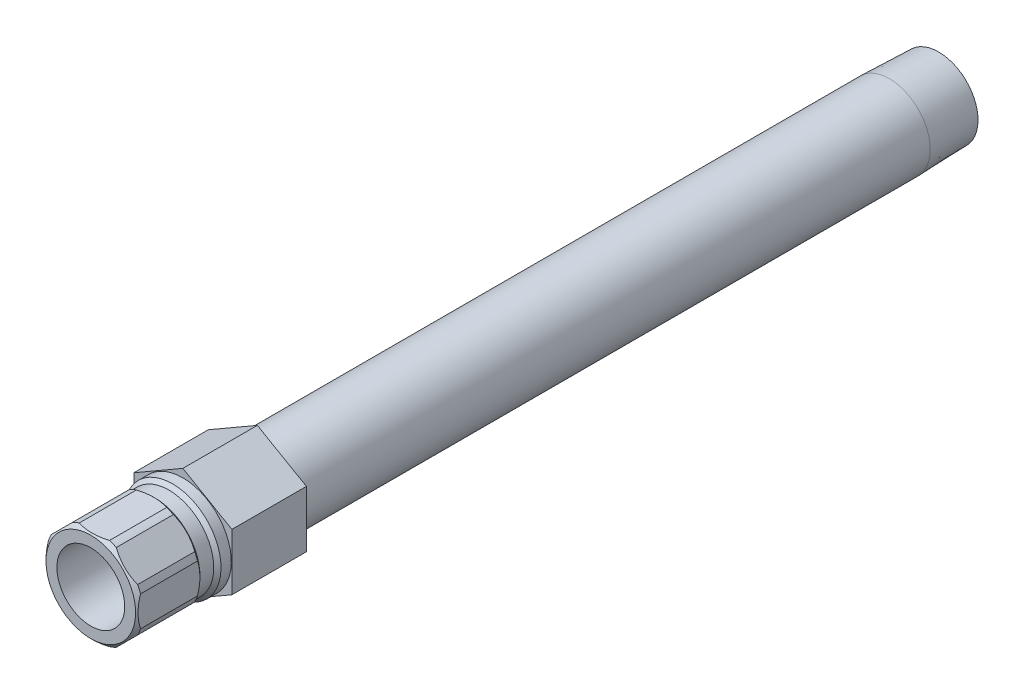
ISO-10303-21;
HEADER;
FILE_DESCRIPTION(('STEP AP214'),'2;1');
FILE_NAME('part.step','',(''),(''),'','','');
FILE_SCHEMA(('AUTOMOTIVE_DESIGN { 1 0 10303 214 1 1 1 1 }'));
ENDSEC;
DATA;
#1=APPLICATION_CONTEXT('core data for automotive mechanical design processes');
#2=APPLICATION_PROTOCOL_DEFINITION('international standard','automotive_design',2000,#1);
#3=PRODUCT_CONTEXT('',#1,'mechanical');
#4=PRODUCT('Part','Part','',(#3));
#5=PRODUCT_RELATED_PRODUCT_CATEGORY('part','',(#4));
#6=PRODUCT_DEFINITION_FORMATION('','',#4);
#7=PRODUCT_DEFINITION_CONTEXT('part definition',#1,'design');
#8=PRODUCT_DEFINITION('design','',#6,#7);
#9=PRODUCT_DEFINITION_SHAPE('','',#8);
#10=(LENGTH_UNIT() NAMED_UNIT(*) SI_UNIT(.MILLI.,.METRE.));
#11=(NAMED_UNIT(*) PLANE_ANGLE_UNIT() SI_UNIT($,.RADIAN.));
#12=(NAMED_UNIT(*) SI_UNIT($,.STERADIAN.) SOLID_ANGLE_UNIT());
#13=UNCERTAINTY_MEASURE_WITH_UNIT(LENGTH_MEASURE(1.E-05),#10,'distance_accuracy_value','');
#14=(GEOMETRIC_REPRESENTATION_CONTEXT(3) GLOBAL_UNCERTAINTY_ASSIGNED_CONTEXT((#13)) GLOBAL_UNIT_ASSIGNED_CONTEXT((#10,
#11,#12)) REPRESENTATION_CONTEXT('',''));
#15=CARTESIAN_POINT('',(0.,0.,0.));
#16=DIRECTION('',(0.,0.,1.));
#17=DIRECTION('',(1.,0.,0.));
#18=AXIS2_PLACEMENT_3D('',#15,#16,#17);
#19=CARTESIAN_POINT('',(0.,0.,0.));
#20=DIRECTION('',(0.,0.,-1.));
#21=DIRECTION('',(0.,1.,0.));
#22=AXIS2_PLACEMENT_3D('',#19,#20,#21);
#23=CYLINDRICAL_SURFACE('',#22,10.16);
#24=DIRECTION('',(0.,0.,-1.));
#25=VECTOR('',#24,1.);
#26=CARTESIAN_POINT('',(9.06826191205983,-4.58172739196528,0.));
#27=LINE('',#26,#25);
#28=CARTESIAN_POINT('',(9.06826191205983,-4.58172739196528,6.5786));
#29=VERTEX_POINT('',#28);
#30=CARTESIAN_POINT('',(9.06826191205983,-4.58172739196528,18.542));
#31=VERTEX_POINT('',#30);
#32=EDGE_CURVE('E525',#29,#31,#27,.F.);
#33=ORIENTED_EDGE('',*,*,#32,.F.);
#34=CARTESIAN_POINT('',(0.,0.,6.5786));
#35=DIRECTION('',(0.,0.,-1.));
#36=DIRECTION('',(0.,1.,0.));
#37=AXIS2_PLACEMENT_3D('',#34,#35,#36);
#38=CIRCLE('',#37,10.16);
#39=CARTESIAN_POINT('',(9.652,-3.17245898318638,6.5786));
#40=VERTEX_POINT('',#39);
#41=EDGE_CURVE('E216',#40,#29,#38,.T.);
#42=ORIENTED_EDGE('',*,*,#41,.F.);
#43=DIRECTION('',(0.,0.,-1.));
#44=VECTOR('',#43,1.);
#45=CARTESIAN_POINT('',(9.652,-3.17245898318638,0.));
#46=LINE('',#45,#44);
#47=CARTESIAN_POINT('',(9.652,-3.17245898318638,18.542));
#48=VERTEX_POINT('',#47);
#49=EDGE_CURVE('E404',#48,#40,#46,.T.);
#50=ORIENTED_EDGE('',*,*,#49,.F.);
#51=CARTESIAN_POINT('',(0.,0.,18.542));
#52=DIRECTION('',(0.,0.,-1.));
#53=DIRECTION('',(0.,1.,0.));
#54=AXIS2_PLACEMENT_3D('',#51,#52,#53);
#55=CIRCLE('',#54,10.16);
#56=EDGE_CURVE('E418',#48,#31,#55,.T.);
#57=ORIENTED_EDGE('',*,*,#56,.T.);
#58=EDGE_LOOP('',(#33,#42,#50,#57));
#59=FACE_BOUND('',#58,.T.);
#60=ADVANCED_FACE('F36',(#59),#23,.T.);
#61=DIRECTION('',(0.,0.,-1.));
#62=VECTOR('',#61,1.);
#63=CARTESIAN_POINT('',(9.652,3.17245898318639,0.));
#64=LINE('',#63,#62);
#65=CARTESIAN_POINT('',(9.652,3.1724589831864,6.57859999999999));
#66=VERTEX_POINT('',#65);
#67=CARTESIAN_POINT('',(9.652,3.17245898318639,18.542));
#68=VERTEX_POINT('',#67);
#69=EDGE_CURVE('E325',#66,#68,#64,.F.);
#70=ORIENTED_EDGE('',*,*,#69,.F.);
#71=CARTESIAN_POINT('',(9.06826191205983,4.58172739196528,6.5786));
#72=VERTEX_POINT('',#71);
#73=EDGE_CURVE('E219',#72,#66,#38,.T.);
#74=ORIENTED_EDGE('',*,*,#73,.F.);
#75=DIRECTION('',(0.,0.,-1.));
#76=VECTOR('',#75,1.);
#77=CARTESIAN_POINT('',(9.06826191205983,4.58172739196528,0.));
#78=LINE('',#77,#76);
#79=CARTESIAN_POINT('',(9.06826191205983,4.58172739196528,18.542));
#80=VERTEX_POINT('',#79);
#81=EDGE_CURVE('E397',#80,#72,#78,.T.);
#82=ORIENTED_EDGE('',*,*,#81,.F.);
#83=EDGE_CURVE('E233',#80,#68,#55,.T.);
#84=ORIENTED_EDGE('',*,*,#83,.T.);
#85=EDGE_LOOP('',(#70,#74,#82,#84));
#86=FACE_BOUND('',#85,.T.);
#87=ADVANCED_FACE('F419',(#86),#23,.T.);
#88=DIRECTION('',(0.,0.,-1.));
#89=VECTOR('',#88,1.);
#90=CARTESIAN_POINT('',(4.58172739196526,9.06826191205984,0.));
#91=LINE('',#90,#89);
#92=CARTESIAN_POINT('',(4.58172739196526,9.06826191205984,6.5786));
#93=VERTEX_POINT('',#92);
#94=CARTESIAN_POINT('',(4.58172739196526,9.06826191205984,18.542));
#95=VERTEX_POINT('',#94);
#96=EDGE_CURVE('E398',#93,#95,#91,.F.);
#97=ORIENTED_EDGE('',*,*,#96,.F.);
#98=CARTESIAN_POINT('',(3.17245898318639,9.652,6.5786));
#99=VERTEX_POINT('',#98);
#100=EDGE_CURVE('E221',#99,#93,#38,.T.);
#101=ORIENTED_EDGE('',*,*,#100,.F.);
#102=DIRECTION('',(0.,0.,-1.));
#103=VECTOR('',#102,1.);
#104=CARTESIAN_POINT('',(3.17245898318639,9.652,0.));
#105=LINE('',#104,#103);
#106=CARTESIAN_POINT('',(3.17245898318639,9.652,18.542));
#107=VERTEX_POINT('',#106);
#108=EDGE_CURVE('E391',#107,#99,#105,.T.);
#109=ORIENTED_EDGE('',*,*,#108,.F.);
#110=EDGE_CURVE('E229',#107,#95,#55,.T.);
#111=ORIENTED_EDGE('',*,*,#110,.T.);
#112=EDGE_LOOP('',(#97,#101,#109,#111));
#113=FACE_BOUND('',#112,.T.);
#114=ADVANCED_FACE('F438',(#113),#23,.T.);
#115=DIRECTION('',(0.,0.,-1.));
#116=VECTOR('',#115,1.);
#117=CARTESIAN_POINT('',(-3.17245898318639,9.652,0.));
#118=LINE('',#117,#116);
#119=CARTESIAN_POINT('',(-3.17245898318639,9.652,6.5786));
#120=VERTEX_POINT('',#119);
#121=CARTESIAN_POINT('',(-3.17245898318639,9.652,18.542));
#122=VERTEX_POINT('',#121);
#123=EDGE_CURVE('E392',#120,#122,#118,.F.);
#124=ORIENTED_EDGE('',*,*,#123,.F.);
#125=CARTESIAN_POINT('',(-4.58172739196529,9.06826191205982,6.5786));
#126=VERTEX_POINT('',#125);
#127=EDGE_CURVE('E226',#126,#120,#38,.T.);
#128=ORIENTED_EDGE('',*,*,#127,.F.);
#129=DIRECTION('',(0.,0.,-1.));
#130=VECTOR('',#129,1.);
#131=CARTESIAN_POINT('',(-4.58172739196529,9.06826191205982,0.));
#132=LINE('',#131,#130);
#133=CARTESIAN_POINT('',(-4.58172739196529,9.06826191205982,18.542));
#134=VERTEX_POINT('',#133);
#135=EDGE_CURVE('E56',#134,#126,#132,.T.);
#136=ORIENTED_EDGE('',*,*,#135,.F.);
#137=EDGE_CURVE('E225',#134,#122,#55,.T.);
#138=ORIENTED_EDGE('',*,*,#137,.T.);
#139=EDGE_LOOP('',(#124,#128,#136,#138));
#140=FACE_BOUND('',#139,.T.);
#141=ADVANCED_FACE('F433',(#140),#23,.T.);
#142=DIRECTION('',(0.,0.,-1.));
#143=VECTOR('',#142,1.);
#144=CARTESIAN_POINT('',(-9.06826191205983,4.58172739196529,0.));
#145=LINE('',#144,#143);
#146=CARTESIAN_POINT('',(-9.06826191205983,4.58172739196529,6.5786));
#147=VERTEX_POINT('',#146);
#148=CARTESIAN_POINT('',(-9.06826191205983,4.58172739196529,18.542));
#149=VERTEX_POINT('',#148);
#150=EDGE_CURVE('E388',#147,#149,#145,.F.);
#151=ORIENTED_EDGE('',*,*,#150,.F.);
#152=CARTESIAN_POINT('',(-9.652,3.17245898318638,6.5786));
#153=VERTEX_POINT('',#152);
#154=EDGE_CURVE('E441',#153,#147,#38,.T.);
#155=ORIENTED_EDGE('',*,*,#154,.F.);
#156=DIRECTION('',(0.,0.,-1.));
#157=VECTOR('',#156,1.);
#158=CARTESIAN_POINT('',(-9.652,3.17245898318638,0.));
#159=LINE('',#158,#157);
#160=CARTESIAN_POINT('',(-9.652,3.17245898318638,18.542));
#161=VERTEX_POINT('',#160);
#162=EDGE_CURVE('E64',#161,#153,#159,.T.);
#163=ORIENTED_EDGE('',*,*,#162,.F.);
#164=EDGE_CURVE('E424',#161,#149,#55,.T.);
#165=ORIENTED_EDGE('',*,*,#164,.T.);
#166=EDGE_LOOP('',(#151,#155,#163,#165));
#167=FACE_BOUND('',#166,.T.);
#168=ADVANCED_FACE('F546',(#167),#23,.T.);
#169=DIRECTION('',(0.,0.,-1.));
#170=VECTOR('',#169,1.);
#171=CARTESIAN_POINT('',(-9.652,-3.17245898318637,0.));
#172=LINE('',#171,#170);
#173=CARTESIAN_POINT('',(-9.652,-3.17245898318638,6.5786));
#174=VERTEX_POINT('',#173);
#175=CARTESIAN_POINT('',(-9.652,-3.17245898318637,18.542));
#176=VERTEX_POINT('',#175);
#177=EDGE_CURVE('E386',#174,#176,#172,.F.);
#178=ORIENTED_EDGE('',*,*,#177,.F.);
#179=CARTESIAN_POINT('',(-9.06826191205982,-4.58172739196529,6.5786));
#180=VERTEX_POINT('',#179);
#181=EDGE_CURVE('E220',#180,#174,#38,.T.);
#182=ORIENTED_EDGE('',*,*,#181,.F.);
#183=DIRECTION('',(0.,0.,-1.));
#184=VECTOR('',#183,1.);
#185=CARTESIAN_POINT('',(-9.06826191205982,-4.58172739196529,0.));
#186=LINE('',#185,#184);
#187=CARTESIAN_POINT('',(-9.06826191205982,-4.58172739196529,18.542));
#188=VERTEX_POINT('',#187);
#189=EDGE_CURVE('E263',#188,#180,#186,.T.);
#190=ORIENTED_EDGE('',*,*,#189,.F.);
#191=EDGE_CURVE('E422',#188,#176,#55,.T.);
#192=ORIENTED_EDGE('',*,*,#191,.T.);
#193=EDGE_LOOP('',(#178,#182,#190,#192));
#194=FACE_BOUND('',#193,.T.);
#195=ADVANCED_FACE('F539',(#194),#23,.T.);
#196=DIRECTION('',(0.,0.,-1.));
#197=VECTOR('',#196,1.);
#198=CARTESIAN_POINT('',(-4.58172739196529,-9.06826191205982,0.));
#199=LINE('',#198,#197);
#200=CARTESIAN_POINT('',(-4.58172739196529,-9.06826191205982,6.5786));
#201=VERTEX_POINT('',#200);
#202=CARTESIAN_POINT('',(-4.58172739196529,-9.06826191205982,18.542));
#203=VERTEX_POINT('',#202);
#204=EDGE_CURVE('E376',#201,#203,#199,.F.);
#205=ORIENTED_EDGE('',*,*,#204,.F.);
#206=CARTESIAN_POINT('',(-3.17245898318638,-9.652,6.5786));
#207=VERTEX_POINT('',#206);
#208=EDGE_CURVE('E217',#207,#201,#38,.T.);
#209=ORIENTED_EDGE('',*,*,#208,.F.);
#210=DIRECTION('',(0.,0.,-1.));
#211=VECTOR('',#210,1.);
#212=CARTESIAN_POINT('',(-3.17245898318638,-9.652,0.));
#213=LINE('',#212,#211);
#214=CARTESIAN_POINT('',(-3.17245898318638,-9.652,18.542));
#215=VERTEX_POINT('',#214);
#216=EDGE_CURVE('E194',#215,#207,#213,.T.);
#217=ORIENTED_EDGE('',*,*,#216,.F.);
#218=EDGE_CURVE('E385',#215,#203,#55,.T.);
#219=ORIENTED_EDGE('',*,*,#218,.T.);
#220=EDGE_LOOP('',(#205,#209,#217,#219));
#221=FACE_BOUND('',#220,.T.);
#222=ADVANCED_FACE('F383',(#221),#23,.T.);
#223=CARTESIAN_POINT('',(0.,0.,0.));
#224=DIRECTION('',(0.,0.,-1.));
#225=DIRECTION('',(0.,1.,0.));
#226=AXIS2_PLACEMENT_3D('',#223,#224,#225);
#227=CYLINDRICAL_SURFACE('',#226,8.5725);
#228=CARTESIAN_POINT('',(0.,0.,-148.1582));
#229=DIRECTION('',(0.,0.,-1.));
#230=DIRECTION('',(0.,1.,0.));
#231=AXIS2_PLACEMENT_3D('',#228,#229,#230);
#232=CIRCLE('',#231,8.5725);
#233=CARTESIAN_POINT('',(0.,8.5725,-148.1582));
#234=VERTEX_POINT('',#233);
#235=EDGE_CURVE('E456',#234,#234,#232,.T.);
#236=ORIENTED_EDGE('',*,*,#235,.F.);
#237=EDGE_LOOP('',(#236));
#238=FACE_BOUND('',#237,.T.);
#239=CARTESIAN_POINT('',(0.,0.,-15.621));
#240=DIRECTION('',(0.,0.,1.));
#241=DIRECTION('',(1.,0.,0.));
#242=AXIS2_PLACEMENT_3D('',#239,#240,#241);
#243=CIRCLE('',#242,8.5725);
#244=CARTESIAN_POINT('',(8.5725,0.,-15.621));
#245=VERTEX_POINT('',#244);
#246=EDGE_CURVE('E471',#245,#245,#243,.F.);
#247=ORIENTED_EDGE('',*,*,#246,.T.);
#248=EDGE_LOOP('',(#247));
#249=FACE_BOUND('',#248,.T.);
#250=ADVANCED_FACE('F538',(#238,#249),#227,.T.);
#251=CARTESIAN_POINT('',(0.,0.,0.));
#252=DIRECTION('',(0.,0.,-1.));
#253=DIRECTION('',(0.,1.,0.));
#254=AXIS2_PLACEMENT_3D('',#251,#252,#253);
#255=CYLINDRICAL_SURFACE('',#254,7.112);
#256=CARTESIAN_POINT('',(0.,0.,1.524));
#257=DIRECTION('',(0.,0.,-1.));
#258=DIRECTION('',(0.,1.,0.));
#259=AXIS2_PLACEMENT_3D('',#256,#257,#258);
#260=CIRCLE('',#259,7.112);
#261=CARTESIAN_POINT('',(0.,7.112,1.524));
#262=VERTEX_POINT('',#261);
#263=EDGE_CURVE('E468',#262,#262,#260,.T.);
#264=ORIENTED_EDGE('',*,*,#263,.T.);
#265=EDGE_LOOP('',(#264));
#266=FACE_BOUND('',#265,.T.);
#267=CARTESIAN_POINT('',(0.,0.,19.304));
#268=DIRECTION('',(0.,0.,-1.));
#269=DIRECTION('',(0.,1.,0.));
#270=AXIS2_PLACEMENT_3D('',#267,#268,#269);
#271=CIRCLE('',#270,7.112);
#272=CARTESIAN_POINT('',(0.,7.112,19.304));
#273=VERTEX_POINT('',#272);
#274=EDGE_CURVE('E200',#273,#273,#271,.T.);
#275=ORIENTED_EDGE('',*,*,#274,.F.);
#276=EDGE_LOOP('',(#275));
#277=FACE_BOUND('',#276,.T.);
#278=ADVANCED_FACE('F38',(#266,#277),#255,.F.);
#279=CARTESIAN_POINT('',(0.,7.112,19.304));
#280=DIRECTION('',(0.,0.,1.));
#281=DIRECTION('',(0.,-1.,0.));
#282=AXIS2_PLACEMENT_3D('',#279,#280,#281);
#283=PLANE('',#282);
#284=ORIENTED_EDGE('',*,*,#274,.T.);
#285=EDGE_LOOP('',(#284));
#286=FACE_BOUND('',#285,.T.);
#287=CARTESIAN_POINT('',(0.,0.,19.304));
#288=DIRECTION('',(0.,0.,-1.));
#289=DIRECTION('',(0.,1.,0.));
#290=AXIS2_PLACEMENT_3D('',#287,#288,#289);
#291=CIRCLE('',#290,9.398);
#292=CARTESIAN_POINT('',(0.,9.398,19.304));
#293=VERTEX_POINT('',#292);
#294=EDGE_CURVE('E232',#293,#293,#291,.T.);
#295=ORIENTED_EDGE('',*,*,#294,.F.);
#296=EDGE_LOOP('',(#295));
#297=FACE_BOUND('',#296,.T.);
#298=ADVANCED_FACE('F269',(#286,#297),#283,.T.);
#299=CARTESIAN_POINT('',(0.,0.,18.542));
#300=DIRECTION('',(0.,0.,-1.));
#301=DIRECTION('',(0.,1.,0.));
#302=AXIS2_PLACEMENT_3D('',#299,#300,#301);
#303=CONICAL_SURFACE('',#302,10.16,0.785398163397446);
#304=CARTESIAN_POINT('',(9.06871478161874,-4.58127452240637,18.5418));
#305=CARTESIAN_POINT('',(8.89746651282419,-4.75252279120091,18.6174888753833));
#306=CARTESIAN_POINT('',(8.72454398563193,-4.92544531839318,18.6860001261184));
#307=CARTESIAN_POINT('',(8.37571487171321,-5.2742744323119,18.8068689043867));
#308=CARTESIAN_POINT('',(8.19980528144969,-5.45018402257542,18.85920901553));
#309=CARTESIAN_POINT('',(7.8498282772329,-5.80016102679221,18.9447662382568));
#310=CARTESIAN_POINT('',(7.67581225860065,-5.97417704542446,18.9783973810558));
#311=CARTESIAN_POINT('',(7.32656572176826,-6.32342358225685,19.0270891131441));
#312=CARTESIAN_POINT('',(7.15133584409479,-6.49865345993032,19.0421588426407));
#313=CARTESIAN_POINT('',(6.77605057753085,-6.87393872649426,19.0538859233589));
#314=CARTESIAN_POINT('',(6.57594647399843,-7.07404283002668,19.0476773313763));
#315=CARTESIAN_POINT('',(6.17675989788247,-7.47322940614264,19.0106603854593));
#316=CARTESIAN_POINT('',(5.97767829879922,-7.67231100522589,18.9798336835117));
#317=CARTESIAN_POINT('',(5.57666706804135,-8.07332223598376,18.8939894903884));
#318=CARTESIAN_POINT('',(5.37480504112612,-8.27518426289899,18.8383431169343));
#319=CARTESIAN_POINT('',(5.07491153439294,-8.57507776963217,18.7386783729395));
#320=CARTESIAN_POINT('',(4.97548345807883,-8.67450584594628,18.7027814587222));
#321=CARTESIAN_POINT('',(4.77762502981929,-8.87236427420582,18.6259657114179));
#322=CARTESIAN_POINT('',(4.67919445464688,-8.97079484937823,18.5850480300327));
#323=CARTESIAN_POINT('',(4.58127452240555,-9.06871478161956,18.5417999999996));
#324=B_SPLINE_CURVE_WITH_KNOTS('',3,(#304,#305,#306,#307,#308,#309,#310,#311,#312,#313,#314,
#315,#316,#317,#318,#319,#320,#321,#322,#323),.UNSPECIFIED.,.F.,.F.,(4,2,2,2,2,2,2,2,2,4),(0.,
0.761268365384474,1.52335378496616,2.26782503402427,3.01192953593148,3.85997332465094,
4.70864975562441,5.58017277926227,6.01546212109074,6.4506517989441),.UNSPECIFIED.);
#325=CARTESIAN_POINT('',(4.58172739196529,-9.06826191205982,18.542));
#326=VERTEX_POINT('',#325);
#327=EDGE_CURVE('E506',#31,#326,#324,.T.);
#328=ORIENTED_EDGE('',*,*,#327,.F.);
#329=ORIENTED_EDGE('',*,*,#56,.F.);
#330=CARTESIAN_POINT('',(9.652,-7.71050187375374,16.3483388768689));
#331=CARTESIAN_POINT('',(9.652,-7.52475481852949,16.4642553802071));
#332=CARTESIAN_POINT('',(9.652,-7.33786285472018,16.5783624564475));
#333=CARTESIAN_POINT('',(9.652,-6.96152272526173,16.8023812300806));
#334=CARTESIAN_POINT('',(9.652,-6.77207395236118,16.9122919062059));
#335=CARTESIAN_POINT('',(9.652,-6.38961701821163,17.1277502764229));
#336=CARTESIAN_POINT('',(9.652,-6.19659699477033,17.2332770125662));
#337=CARTESIAN_POINT('',(9.652,-5.80760245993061,17.4386922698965));
#338=CARTESIAN_POINT('',(9.652,-5.6116281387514,17.5385811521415));
#339=CARTESIAN_POINT('',(9.652,-5.01021259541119,17.8328232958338));
#340=CARTESIAN_POINT('',(9.652,-4.59965798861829,18.0169416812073));
#341=CARTESIAN_POINT('',(9.652,-3.76461195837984,18.3488686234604));
#342=CARTESIAN_POINT('',(9.652,-3.34014745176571,18.4967430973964));
#343=CARTESIAN_POINT('',(9.652,-2.66836152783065,18.6905975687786));
#344=CARTESIAN_POINT('',(9.652,-2.42567962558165,18.7527238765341));
#345=CARTESIAN_POINT('',(9.652,-1.9366245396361,18.860517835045));
#346=CARTESIAN_POINT('',(9.652,-1.69025117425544,18.9061846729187));
#347=CARTESIAN_POINT('',(9.652,-1.1971622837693,18.9790662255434));
#348=CARTESIAN_POINT('',(9.652,-0.95047238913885,19.0064526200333));
#349=CARTESIAN_POINT('',(9.652,-0.45571021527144,19.0423990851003));
#350=CARTESIAN_POINT('',(9.652,-0.207637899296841,19.0509586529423));
#351=CARTESIAN_POINT('',(9.652,0.333683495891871,19.048681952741));
#352=CARTESIAN_POINT('',(9.652,0.626923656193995,19.0340251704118));
#353=CARTESIAN_POINT('',(9.652,1.21094277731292,18.9786837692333));
#354=CARTESIAN_POINT('',(9.652,1.501721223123,18.9379938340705));
#355=CARTESIAN_POINT('',(9.652,2.08266136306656,18.8320509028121));
#356=CARTESIAN_POINT('',(9.652,2.3727646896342,18.7664820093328));
#357=CARTESIAN_POINT('',(9.652,2.94714147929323,18.6138865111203));
#358=CARTESIAN_POINT('',(9.652,3.23141585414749,18.5268632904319));
#359=CARTESIAN_POINT('',(9.652,3.82869981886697,18.3226103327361));
#360=CARTESIAN_POINT('',(9.652,4.14087760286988,18.2029681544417));
#361=CARTESIAN_POINT('',(9.652,4.75742701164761,17.9448741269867));
#362=CARTESIAN_POINT('',(9.652,5.0617950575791,17.8064138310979));
#363=CARTESIAN_POINT('',(9.652,5.66409479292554,17.5139015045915));
#364=CARTESIAN_POINT('',(9.652,5.96200267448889,17.3598008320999));
#365=CARTESIAN_POINT('',(9.652,6.55107386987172,17.0393844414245));
#366=CARTESIAN_POINT('',(9.652,6.84223818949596,16.8730705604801));
#367=CARTESIAN_POINT('',(9.652,7.40668231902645,16.5376791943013));
#368=CARTESIAN_POINT('',(9.652,7.68020242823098,16.3690040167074));
#369=CARTESIAN_POINT('',(9.652,8.22250898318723,16.0241853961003));
#370=CARTESIAN_POINT('',(9.652,8.49129505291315,15.848041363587));
#371=CARTESIAN_POINT('',(9.652,9.02258177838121,15.4910339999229));
#372=CARTESIAN_POINT('',(9.652,9.28511552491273,15.3102197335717));
#373=CARTESIAN_POINT('',(9.652,9.80652727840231,14.9435456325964));
#374=CARTESIAN_POINT('',(9.652,10.0654063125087,14.7576872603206));
#375=CARTESIAN_POINT('',(9.652,10.3227473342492,14.5697596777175));
#376=B_SPLINE_CURVE_WITH_KNOTS('',3,(#330,#331,#332,#333,#334,#335,#336,#337,#338,#339,#340,
#341,#342,#343,#344,#345,#346,#347,#348,#349,#350,#351,#352,#353,#354,#355,#356,#357,#358,#359,
#360,#361,#362,#363,#364,#365,#366,#367,#368,#369,#370,#371,#372,#373,#374,#375),.UNSPECIFIED.,
.F.,.F.,(4,2,2,2,2,2,2,2,2,2,2,2,2,2,2,2,2,2,2,2,2,2,4),(0.,0.656855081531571,1.31386901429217,
1.97372850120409,2.63354568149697,3.98211483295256,5.32821282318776,6.07925616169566,
6.83033658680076,7.5742601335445,8.31820354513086,9.1977741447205,10.0775244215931,
10.9688407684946,11.8600166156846,12.8622077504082,13.8648502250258,14.8707124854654,
15.8764237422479,16.8403261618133,17.8043048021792,18.7605668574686,19.7165545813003),.UNSPECIFIED.);
#377=EDGE_CURVE('E317',#68,#48,#376,.F.);
#378=ORIENTED_EDGE('',*,*,#377,.F.);
#379=ORIENTED_EDGE('',*,*,#83,.F.);
#380=CARTESIAN_POINT('',(4.58127452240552,9.06871478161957,18.5417999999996));
#381=CARTESIAN_POINT('',(4.75252279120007,8.89746651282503,18.617488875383));
#382=CARTESIAN_POINT('',(4.92544531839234,8.72454398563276,18.6860001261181));
#383=CARTESIAN_POINT('',(5.27427443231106,8.37571487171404,18.8068689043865));
#384=CARTESIAN_POINT('',(5.45018402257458,8.19980528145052,18.8592090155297));
#385=CARTESIAN_POINT('',(5.80016102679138,7.84982827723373,18.9447662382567));
#386=CARTESIAN_POINT('',(5.97417704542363,7.67581225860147,18.9783973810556));
#387=CARTESIAN_POINT('',(6.32342358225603,7.32656572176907,19.027089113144));
#388=CARTESIAN_POINT('',(6.4986534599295,7.1513358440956,19.0421588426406));
#389=CARTESIAN_POINT('',(6.87393872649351,6.77605057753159,19.0538859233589));
#390=CARTESIAN_POINT('',(7.074042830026,6.57594647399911,19.0476773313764));
#391=CARTESIAN_POINT('',(7.4732294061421,6.17675989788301,19.0106603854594));
#392=CARTESIAN_POINT('',(7.67231100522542,5.97767829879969,18.9798336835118));
#393=CARTESIAN_POINT('',(8.07332223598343,5.57666706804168,18.8939894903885));
#394=CARTESIAN_POINT('',(8.27518426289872,5.37480504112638,18.8383431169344));
#395=CARTESIAN_POINT('',(8.57507776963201,5.07491153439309,18.7386783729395));
#396=CARTESIAN_POINT('',(8.67450584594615,4.97548345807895,18.7027814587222));
#397=CARTESIAN_POINT('',(8.87236427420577,4.77762502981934,18.6259657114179));
#398=CARTESIAN_POINT('',(8.9707948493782,4.6791944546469,18.5850480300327));
#399=CARTESIAN_POINT('',(9.06871478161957,4.58127452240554,18.5417999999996));
#400=B_SPLINE_CURVE_WITH_KNOTS('',3,(#380,#381,#382,#383,#384,#385,#386,#387,#388,#389,#390,
#391,#392,#393,#394,#395,#396,#397,#398,#399),.UNSPECIFIED.,.F.,.F.,(4,2,2,2,2,2,2,2,2,4),(0.,
0.761268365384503,1.52335378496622,2.26782503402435,3.01192953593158,3.85997332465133,
4.70864975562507,5.58017277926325,6.01546212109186,6.45065179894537),.UNSPECIFIED.);
#401=EDGE_CURVE('E309',#95,#80,#400,.T.);
#402=ORIENTED_EDGE('',*,*,#401,.F.);
#403=ORIENTED_EDGE('',*,*,#110,.F.);
#404=CARTESIAN_POINT('',(-7.71050187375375,9.652,16.3483388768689));
#405=CARTESIAN_POINT('',(-7.5247548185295,9.652,16.4642553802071));
#406=CARTESIAN_POINT('',(-7.33786285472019,9.652,16.5783624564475));
#407=CARTESIAN_POINT('',(-6.96152272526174,9.652,16.8023812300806));
#408=CARTESIAN_POINT('',(-6.77207395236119,9.652,16.9122919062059));
#409=CARTESIAN_POINT('',(-6.38961701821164,9.652,17.1277502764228));
#410=CARTESIAN_POINT('',(-6.19659699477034,9.652,17.2332770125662));
#411=CARTESIAN_POINT('',(-5.80760245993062,9.652,17.4386922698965));
#412=CARTESIAN_POINT('',(-5.61162813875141,9.652,17.5385811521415));
#413=CARTESIAN_POINT('',(-5.0102125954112,9.652,17.8328232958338));
#414=CARTESIAN_POINT('',(-4.5996579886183,9.652,18.0169416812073));
#415=CARTESIAN_POINT('',(-3.76461195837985,9.652,18.3488686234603));
#416=CARTESIAN_POINT('',(-3.34014745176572,9.652,18.4967430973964));
#417=CARTESIAN_POINT('',(-2.66836152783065,9.652,18.6905975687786));
#418=CARTESIAN_POINT('',(-2.42567962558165,9.652,18.7527238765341));
#419=CARTESIAN_POINT('',(-1.9366245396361,9.652,18.860517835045));
#420=CARTESIAN_POINT('',(-1.69025117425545,9.652,18.9061846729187));
#421=CARTESIAN_POINT('',(-1.19716228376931,9.652,18.9790662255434));
#422=CARTESIAN_POINT('',(-0.950472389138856,9.652,19.0064526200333));
#423=CARTESIAN_POINT('',(-0.455710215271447,9.652,19.0423990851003));
#424=CARTESIAN_POINT('',(-0.207637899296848,9.652,19.0509586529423));
#425=CARTESIAN_POINT('',(0.333683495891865,9.652,19.048681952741));
#426=CARTESIAN_POINT('',(0.626923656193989,9.652,19.0340251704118));
#427=CARTESIAN_POINT('',(1.21094277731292,9.652,18.9786837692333));
#428=CARTESIAN_POINT('',(1.50172122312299,9.652,18.9379938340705));
#429=CARTESIAN_POINT('',(2.08266136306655,9.652,18.8320509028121));
#430=CARTESIAN_POINT('',(2.3727646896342,9.652,18.7664820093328));
#431=CARTESIAN_POINT('',(2.94714147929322,9.652,18.6138865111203));
#432=CARTESIAN_POINT('',(3.23141585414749,9.652,18.5268632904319));
#433=CARTESIAN_POINT('',(3.82869981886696,9.652,18.3226103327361));
#434=CARTESIAN_POINT('',(4.14087760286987,9.652,18.2029681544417));
#435=CARTESIAN_POINT('',(4.7574270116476,9.652,17.9448741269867));
#436=CARTESIAN_POINT('',(5.06179505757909,9.652,17.8064138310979));
#437=CARTESIAN_POINT('',(5.66409479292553,9.652,17.5139015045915));
#438=CARTESIAN_POINT('',(5.96200267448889,9.652,17.3598008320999));
#439=CARTESIAN_POINT('',(6.55107386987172,9.652,17.0393844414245));
#440=CARTESIAN_POINT('',(6.84223818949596,9.652,16.8730705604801));
#441=CARTESIAN_POINT('',(7.40668231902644,9.652,16.5376791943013));
#442=CARTESIAN_POINT('',(7.68020242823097,9.652,16.3690040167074));
#443=CARTESIAN_POINT('',(8.22250898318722,9.652,16.0241853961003));
#444=CARTESIAN_POINT('',(8.49129505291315,9.652,15.848041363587));
#445=CARTESIAN_POINT('',(9.0225817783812,9.652,15.4910339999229));
#446=CARTESIAN_POINT('',(9.28511552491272,9.652,15.3102197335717));
#447=CARTESIAN_POINT('',(9.8065272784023,9.652,14.9435456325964));
#448=CARTESIAN_POINT('',(10.0654063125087,9.652,14.7576872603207));
#449=CARTESIAN_POINT('',(10.3227473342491,9.652,14.5697596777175));
#450=B_SPLINE_CURVE_WITH_KNOTS('',3,(#404,#405,#406,#407,#408,#409,#410,#411,#412,#413,#414,
#415,#416,#417,#418,#419,#420,#421,#422,#423,#424,#425,#426,#427,#428,#429,#430,#431,#432,#433,
#434,#435,#436,#437,#438,#439,#440,#441,#442,#443,#444,#445,#446,#447,#448,#449),.UNSPECIFIED.,
.F.,.F.,(4,2,2,2,2,2,2,2,2,2,2,2,2,2,2,2,2,2,2,2,2,2,4),(0.,0.656855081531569,1.31386901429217,
1.97372850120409,2.63354568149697,3.98211483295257,5.32821282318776,6.07925616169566,
6.83033658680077,7.57426013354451,8.31820354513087,9.1977741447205,10.0775244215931,
10.9688407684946,11.8600166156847,12.8622077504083,13.8648502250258,14.8707124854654,
15.8764237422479,16.8403261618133,17.8043048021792,18.7605668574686,19.7165545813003),.UNSPECIFIED.);
#451=EDGE_CURVE('E301',#122,#107,#450,.T.);
#452=ORIENTED_EDGE('',*,*,#451,.F.);
#453=ORIENTED_EDGE('',*,*,#137,.F.);
#454=CARTESIAN_POINT('',(-9.06871478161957,4.58127452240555,18.5417999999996));
#455=CARTESIAN_POINT('',(-8.89746651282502,4.75252279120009,18.617488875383));
#456=CARTESIAN_POINT('',(-8.72454398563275,4.92544531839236,18.6860001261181));
#457=CARTESIAN_POINT('',(-8.37571487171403,5.27427443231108,18.8068689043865));
#458=CARTESIAN_POINT('',(-8.19980528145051,5.4501840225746,18.8592090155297));
#459=CARTESIAN_POINT('',(-7.84982827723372,5.80016102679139,18.9447662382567));
#460=CARTESIAN_POINT('',(-7.67581225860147,5.97417704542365,18.9783973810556));
#461=CARTESIAN_POINT('',(-7.32656572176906,6.32342358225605,19.027089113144));
#462=CARTESIAN_POINT('',(-7.15133584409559,6.49865345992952,19.0421588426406));
#463=CARTESIAN_POINT('',(-6.77605057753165,6.87393872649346,19.0538859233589));
#464=CARTESIAN_POINT('',(-6.57594647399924,7.07404283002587,19.0476773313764));
#465=CARTESIAN_POINT('',(-6.17675989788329,7.47322940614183,19.0106603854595));
#466=CARTESIAN_POINT('',(-5.97767829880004,7.67231100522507,18.9798336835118));
#467=CARTESIAN_POINT('',(-5.57666706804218,8.07332223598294,18.8939894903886));
#468=CARTESIAN_POINT('',(-5.37480504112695,8.27518426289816,18.8383431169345));
#469=CARTESIAN_POINT('',(-5.07491153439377,8.57507776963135,18.7386783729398));
#470=CARTESIAN_POINT('',(-4.97548345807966,8.67450584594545,18.7027814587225));
#471=CARTESIAN_POINT('',(-4.77762502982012,8.872364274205,18.6259657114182));
#472=CARTESIAN_POINT('',(-4.67919445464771,8.9707948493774,18.585048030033));
#473=CARTESIAN_POINT('',(-4.58127452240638,9.06871478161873,18.5418));
#474=B_SPLINE_CURVE_WITH_KNOTS('',3,(#454,#455,#456,#457,#458,#459,#460,#461,#462,#463,#464,
#465,#466,#467,#468,#469,#470,#471,#472,#473),.UNSPECIFIED.,.F.,.F.,(4,2,2,2,2,2,2,2,2,4),(0.,
0.761268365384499,1.52335378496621,2.26782503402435,3.01192953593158,3.85997332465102,
4.70864975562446,5.5801727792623,6.01546212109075,6.4506517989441),.UNSPECIFIED.);
#475=EDGE_CURVE('E292',#149,#134,#474,.T.);
#476=ORIENTED_EDGE('',*,*,#475,.F.);
#477=ORIENTED_EDGE('',*,*,#164,.F.);
#478=CARTESIAN_POINT('',(-9.652,-7.71050187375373,16.3483388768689));
#479=CARTESIAN_POINT('',(-9.652,-7.52475481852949,16.4642553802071));
#480=CARTESIAN_POINT('',(-9.652,-7.33786285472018,16.5783624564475));
#481=CARTESIAN_POINT('',(-9.652,-6.96152272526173,16.8023812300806));
#482=CARTESIAN_POINT('',(-9.652,-6.77207395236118,16.9122919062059));
#483=CARTESIAN_POINT('',(-9.652,-6.38961701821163,17.1277502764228));
#484=CARTESIAN_POINT('',(-9.652,-6.19659699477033,17.2332770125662));
#485=CARTESIAN_POINT('',(-9.652,-5.8076024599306,17.4386922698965));
#486=CARTESIAN_POINT('',(-9.652,-5.6116281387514,17.5385811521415));
#487=CARTESIAN_POINT('',(-9.652,-5.01021259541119,17.8328232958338));
#488=CARTESIAN_POINT('',(-9.652,-4.59965798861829,18.0169416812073));
#489=CARTESIAN_POINT('',(-9.652,-3.76461195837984,18.3488686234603));
#490=CARTESIAN_POINT('',(-9.652,-3.34014745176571,18.4967430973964));
#491=CARTESIAN_POINT('',(-9.652,-2.66836152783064,18.6905975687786));
#492=CARTESIAN_POINT('',(-9.652,-2.42567962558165,18.7527238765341));
#493=CARTESIAN_POINT('',(-9.652,-1.9366245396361,18.860517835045));
#494=CARTESIAN_POINT('',(-9.652,-1.69025117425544,18.9061846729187));
#495=CARTESIAN_POINT('',(-9.652,-1.1971622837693,18.9790662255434));
#496=CARTESIAN_POINT('',(-9.652,-0.950472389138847,19.0064526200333));
#497=CARTESIAN_POINT('',(-9.652,-0.455710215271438,19.0423990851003));
#498=CARTESIAN_POINT('',(-9.652,-0.207637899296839,19.0509586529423));
#499=CARTESIAN_POINT('',(-9.652,0.333683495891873,19.048681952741));
#500=CARTESIAN_POINT('',(-9.652,0.626923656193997,19.0340251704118));
#501=CARTESIAN_POINT('',(-9.652,1.21094277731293,18.9786837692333));
#502=CARTESIAN_POINT('',(-9.652,1.501721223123,18.9379938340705));
#503=CARTESIAN_POINT('',(-9.652,2.08266136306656,18.8320509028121));
#504=CARTESIAN_POINT('',(-9.652,2.3727646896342,18.7664820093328));
#505=CARTESIAN_POINT('',(-9.652,2.94714147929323,18.6138865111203));
#506=CARTESIAN_POINT('',(-9.652,3.23141585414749,18.5268632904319));
#507=CARTESIAN_POINT('',(-9.652,3.82869981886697,18.3226103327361));
#508=CARTESIAN_POINT('',(-9.652,4.14087760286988,18.2029681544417));
#509=CARTESIAN_POINT('',(-9.652,4.75742701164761,17.9448741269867));
#510=CARTESIAN_POINT('',(-9.652,5.0617950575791,17.8064138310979));
#511=CARTESIAN_POINT('',(-9.652,5.66409479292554,17.5139015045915));
#512=CARTESIAN_POINT('',(-9.652,5.9620026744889,17.3598008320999));
#513=CARTESIAN_POINT('',(-9.652,6.55107386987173,17.0393844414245));
#514=CARTESIAN_POINT('',(-9.652,6.84223818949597,16.8730705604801));
#515=CARTESIAN_POINT('',(-9.652,7.40668231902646,16.5376791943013));
#516=CARTESIAN_POINT('',(-9.652,7.68020242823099,16.3690040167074));
#517=CARTESIAN_POINT('',(-9.652,8.22250898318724,16.0241853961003));
#518=CARTESIAN_POINT('',(-9.652,8.49129505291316,15.848041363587));
#519=CARTESIAN_POINT('',(-9.652,9.02258177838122,15.4910339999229));
#520=CARTESIAN_POINT('',(-9.652,9.28511552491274,15.3102197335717));
#521=CARTESIAN_POINT('',(-9.652,9.80652727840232,14.9435456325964));
#522=CARTESIAN_POINT('',(-9.652,10.0654063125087,14.7576872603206));
#523=CARTESIAN_POINT('',(-9.652,10.3227473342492,14.5697596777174));
#524=B_SPLINE_CURVE_WITH_KNOTS('',3,(#478,#479,#480,#481,#482,#483,#484,#485,#486,#487,#488,
#489,#490,#491,#492,#493,#494,#495,#496,#497,#498,#499,#500,#501,#502,#503,#504,#505,#506,#507,
#508,#509,#510,#511,#512,#513,#514,#515,#516,#517,#518,#519,#520,#521,#522,#523),.UNSPECIFIED.,
.F.,.F.,(4,2,2,2,2,2,2,2,2,2,2,2,2,2,2,2,2,2,2,2,2,2,4),(0.,0.656855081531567,1.31386901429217,
1.97372850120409,2.63354568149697,3.98211483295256,5.32821282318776,6.07925616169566,
6.83033658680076,7.5742601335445,8.31820354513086,9.1977741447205,10.0775244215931,
10.9688407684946,11.8600166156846,12.8622077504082,13.8648502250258,14.8707124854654,
15.8764237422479,16.8403261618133,17.8043048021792,18.7605668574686,19.7165545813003),.UNSPECIFIED.);
#525=EDGE_CURVE('E284',#176,#161,#524,.T.);
#526=ORIENTED_EDGE('',*,*,#525,.F.);
#527=ORIENTED_EDGE('',*,*,#191,.F.);
#528=CARTESIAN_POINT('',(-4.58127452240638,-9.06871478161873,18.5418));
#529=CARTESIAN_POINT('',(-4.75252279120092,-8.89746651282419,18.6174888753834));
#530=CARTESIAN_POINT('',(-4.92544531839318,-8.72454398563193,18.6860001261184));
#531=CARTESIAN_POINT('',(-5.2742744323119,-8.37571487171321,18.8068689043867));
#532=CARTESIAN_POINT('',(-5.45018402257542,-8.19980528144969,18.85920901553));
#533=CARTESIAN_POINT('',(-5.80016102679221,-7.8498282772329,18.9447662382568));
#534=CARTESIAN_POINT('',(-5.97417704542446,-7.67581225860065,18.9783973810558));
#535=CARTESIAN_POINT('',(-6.32342358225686,-7.32656572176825,19.0270891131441));
#536=CARTESIAN_POINT('',(-6.49865345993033,-7.15133584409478,19.0421588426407));
#537=CARTESIAN_POINT('',(-6.87393872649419,-6.77605057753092,19.0538859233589));
#538=CARTESIAN_POINT('',(-7.07404283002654,-6.57594647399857,19.0476773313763));
#539=CARTESIAN_POINT('',(-7.47322940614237,-6.17675989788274,19.0106603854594));
#540=CARTESIAN_POINT('',(-7.67231100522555,-5.97767829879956,18.9798336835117));
#541=CARTESIAN_POINT('',(-8.07332223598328,-5.57666706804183,18.8939894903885));
#542=CARTESIAN_POINT('',(-8.27518426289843,-5.37480504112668,18.8383431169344));
#543=CARTESIAN_POINT('',(-8.57507776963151,-5.0749115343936,18.7386783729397));
#544=CARTESIAN_POINT('',(-8.67450584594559,-4.97548345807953,18.7027814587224));
#545=CARTESIAN_POINT('',(-8.87236427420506,-4.77762502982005,18.6259657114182));
#546=CARTESIAN_POINT('',(-8.97079484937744,-4.67919445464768,18.585048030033));
#547=CARTESIAN_POINT('',(-9.06871478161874,-4.58127452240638,18.5418));
#548=B_SPLINE_CURVE_WITH_KNOTS('',3,(#528,#529,#530,#531,#532,#533,#534,#535,#536,#537,#538,
#539,#540,#541,#542,#543,#544,#545,#546,#547),.UNSPECIFIED.,.F.,.F.,(4,2,2,2,2,2,2,2,2,4),(0.,
0.761268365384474,1.52335378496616,2.26782503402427,3.01192953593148,3.85997332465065,
4.70864975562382,5.58017277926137,6.01546212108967,6.45065179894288),.UNSPECIFIED.);
#549=EDGE_CURVE('E277',#203,#188,#548,.T.);
#550=ORIENTED_EDGE('',*,*,#549,.F.);
#551=ORIENTED_EDGE('',*,*,#218,.F.);
#552=CARTESIAN_POINT('',(-7.71050187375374,-9.652,16.3483388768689));
#553=CARTESIAN_POINT('',(-7.52475481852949,-9.652,16.4642553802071));
#554=CARTESIAN_POINT('',(-7.33786285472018,-9.652,16.5783624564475));
#555=CARTESIAN_POINT('',(-6.96152272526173,-9.652,16.8023812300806));
#556=CARTESIAN_POINT('',(-6.77207395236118,-9.652,16.9122919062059));
#557=CARTESIAN_POINT('',(-6.38961701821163,-9.652,17.1277502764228));
#558=CARTESIAN_POINT('',(-6.19659699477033,-9.652,17.2332770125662));
#559=CARTESIAN_POINT('',(-5.80760245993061,-9.652,17.4386922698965));
#560=CARTESIAN_POINT('',(-5.6116281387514,-9.652,17.5385811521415));
#561=CARTESIAN_POINT('',(-5.01021259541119,-9.652,17.8328232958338));
#562=CARTESIAN_POINT('',(-4.59965798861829,-9.652,18.0169416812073));
#563=CARTESIAN_POINT('',(-3.76461195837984,-9.652,18.3488686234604));
#564=CARTESIAN_POINT('',(-3.34014745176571,-9.652,18.4967430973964));
#565=CARTESIAN_POINT('',(-2.66836152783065,-9.652,18.6905975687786));
#566=CARTESIAN_POINT('',(-2.42567962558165,-9.652,18.7527238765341));
#567=CARTESIAN_POINT('',(-1.9366245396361,-9.652,18.860517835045));
#568=CARTESIAN_POINT('',(-1.69025117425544,-9.652,18.9061846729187));
#569=CARTESIAN_POINT('',(-1.1971622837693,-9.652,18.9790662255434));
#570=CARTESIAN_POINT('',(-0.950472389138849,-9.652,19.0064526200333));
#571=CARTESIAN_POINT('',(-0.45571021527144,-9.652,19.0423990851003));
#572=CARTESIAN_POINT('',(-0.20763789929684,-9.652,19.0509586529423));
#573=CARTESIAN_POINT('',(0.333683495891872,-9.652,19.048681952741));
#574=CARTESIAN_POINT('',(0.626923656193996,-9.652,19.0340251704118));
#575=CARTESIAN_POINT('',(1.21094277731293,-9.652,18.9786837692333));
#576=CARTESIAN_POINT('',(1.501721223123,-9.652,18.9379938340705));
#577=CARTESIAN_POINT('',(2.08266136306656,-9.652,18.8320509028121));
#578=CARTESIAN_POINT('',(2.3727646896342,-9.652,18.7664820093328));
#579=CARTESIAN_POINT('',(2.94714147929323,-9.652,18.6138865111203));
#580=CARTESIAN_POINT('',(3.23141585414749,-9.652,18.5268632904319));
#581=CARTESIAN_POINT('',(3.82869981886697,-9.652,18.3226103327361));
#582=CARTESIAN_POINT('',(4.14087760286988,-9.652,18.2029681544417));
#583=CARTESIAN_POINT('',(4.75742701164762,-9.652,17.9448741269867));
#584=CARTESIAN_POINT('',(5.0617950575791,-9.652,17.8064138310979));
#585=CARTESIAN_POINT('',(5.66409479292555,-9.652,17.5139015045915));
#586=CARTESIAN_POINT('',(5.9620026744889,-9.652,17.3598008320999));
#587=CARTESIAN_POINT('',(6.55107386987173,-9.652,17.0393844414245));
#588=CARTESIAN_POINT('',(6.84223818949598,-9.652,16.8730705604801));
#589=CARTESIAN_POINT('',(7.40668231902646,-9.652,16.5376791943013));
#590=CARTESIAN_POINT('',(7.68020242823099,-9.652,16.3690040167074));
#591=CARTESIAN_POINT('',(8.22250898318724,-9.652,16.0241853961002));
#592=CARTESIAN_POINT('',(8.49129505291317,-9.652,15.848041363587));
#593=CARTESIAN_POINT('',(9.02258177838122,-9.652,15.4910339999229));
#594=CARTESIAN_POINT('',(9.28511552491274,-9.652,15.3102197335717));
#595=CARTESIAN_POINT('',(9.80652727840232,-9.652,14.9435456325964));
#596=CARTESIAN_POINT('',(10.0654063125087,-9.652,14.7576872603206));
#597=CARTESIAN_POINT('',(10.3227473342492,-9.652,14.5697596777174));
#598=B_SPLINE_CURVE_WITH_KNOTS('',3,(#552,#553,#554,#555,#556,#557,#558,#559,#560,#561,#562,
#563,#564,#565,#566,#567,#568,#569,#570,#571,#572,#573,#574,#575,#576,#577,#578,#579,#580,#581,
#582,#583,#584,#585,#586,#587,#588,#589,#590,#591,#592,#593,#594,#595,#596,#597),.UNSPECIFIED.,
.F.,.F.,(4,2,2,2,2,2,2,2,2,2,2,2,2,2,2,2,2,2,2,2,2,2,4),(0.,0.656855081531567,1.31386901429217,
1.97372850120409,2.63354568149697,3.98211483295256,5.32821282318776,6.07925616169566,
6.83033658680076,7.5742601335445,8.31820354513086,9.1977741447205,10.0775244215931,
10.9688407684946,11.8600166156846,12.8622077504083,13.8648502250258,14.8707124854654,
15.8764237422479,16.8403261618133,17.8043048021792,18.7605668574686,19.7165545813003),.UNSPECIFIED.);
#599=CARTESIAN_POINT('',(3.17245898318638,-9.652,18.542));
#600=VERTEX_POINT('',#599);
#601=EDGE_CURVE('E210',#600,#215,#598,.F.);
#602=ORIENTED_EDGE('',*,*,#601,.F.);
#603=EDGE_CURVE('E209',#326,#600,#55,.T.);
#604=ORIENTED_EDGE('',*,*,#603,.F.);
#605=EDGE_LOOP('',(#328,#329,#378,#379,#402,#403,#452,#453,#476,#477,#526,#527,#550,#551,#602,#604));
#606=FACE_BOUND('',#605,.T.);
#607=ORIENTED_EDGE('',*,*,#294,.T.);
#608=EDGE_LOOP('',(#607));
#609=FACE_BOUND('',#608,.T.);
#610=ADVANCED_FACE('F266',(#606,#609),#303,.T.);
#611=DIRECTION('',(0.,0.,-1.));
#612=VECTOR('',#611,1.);
#613=CARTESIAN_POINT('',(4.58172739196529,-9.06826191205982,0.));
#614=LINE('',#613,#612);
#615=CARTESIAN_POINT('',(4.58172739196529,-9.06826191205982,6.5786));
#616=VERTEX_POINT('',#615);
#617=EDGE_CURVE('E324',#326,#616,#614,.T.);
#618=ORIENTED_EDGE('',*,*,#617,.F.);
#619=ORIENTED_EDGE('',*,*,#603,.T.);
#620=DIRECTION('',(0.,0.,-1.));
#621=VECTOR('',#620,1.);
#622=CARTESIAN_POINT('',(3.17245898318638,-9.652,0.));
#623=LINE('',#622,#621);
#624=CARTESIAN_POINT('',(3.1724589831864,-9.652,6.57859999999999));
#625=VERTEX_POINT('',#624);
#626=EDGE_CURVE('E191',#625,#600,#623,.F.);
#627=ORIENTED_EDGE('',*,*,#626,.F.);
#628=EDGE_CURVE('E207',#616,#625,#38,.T.);
#629=ORIENTED_EDGE('',*,*,#628,.F.);
#630=EDGE_LOOP('',(#618,#619,#627,#629));
#631=FACE_BOUND('',#630,.T.);
#632=ADVANCED_FACE('F206',(#631),#23,.T.);
#633=CARTESIAN_POINT('',(0.,0.,5.8166));
#634=DIRECTION('',(0.,0.,1.));
#635=DIRECTION('',(0.,-1.,0.));
#636=AXIS2_PLACEMENT_3D('',#633,#634,#635);
#637=CONICAL_SURFACE('',#636,9.398,0.785398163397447);
#638=CARTESIAN_POINT('',(4.58127452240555,-9.06871478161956,6.57880000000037));
#639=CARTESIAN_POINT('',(4.75252279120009,-8.89746651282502,6.50311112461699));
#640=CARTESIAN_POINT('',(4.92544531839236,-8.72454398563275,6.4345998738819));
#641=CARTESIAN_POINT('',(5.27427443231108,-8.37571487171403,6.31373109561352));
#642=CARTESIAN_POINT('',(5.4501840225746,-8.19980528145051,6.26139098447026));
#643=CARTESIAN_POINT('',(5.8001610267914,-7.84982827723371,6.17583376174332));
#644=CARTESIAN_POINT('',(5.97417704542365,-7.67581225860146,6.14220261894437));
#645=CARTESIAN_POINT('',(6.32342358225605,-7.32656572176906,6.09351088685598));
#646=CARTESIAN_POINT('',(6.49865345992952,-7.15133584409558,6.07844115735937));
#647=CARTESIAN_POINT('',(6.87393872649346,-6.77605057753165,6.06671407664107));
#648=CARTESIAN_POINT('',(7.07404283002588,-6.57594647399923,6.07292266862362));
#649=CARTESIAN_POINT('',(7.47322940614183,-6.17675989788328,6.10993961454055));
#650=CARTESIAN_POINT('',(7.67231100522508,-5.97767829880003,6.14076631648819));
#651=CARTESIAN_POINT('',(8.07332223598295,-5.57666706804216,6.22661050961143));
#652=CARTESIAN_POINT('',(8.27518426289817,-5.37480504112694,6.28225688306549));
#653=CARTESIAN_POINT('',(8.57507776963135,-5.07491153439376,6.38192162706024));
#654=CARTESIAN_POINT('',(8.67450584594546,-4.97548345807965,6.41781854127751));
#655=CARTESIAN_POINT('',(8.872364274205,-4.77762502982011,6.49463428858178));
#656=CARTESIAN_POINT('',(8.97079484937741,-4.6791944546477,6.53555196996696));
#657=CARTESIAN_POINT('',(9.06871478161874,-4.58127452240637,6.5788));
#658=B_SPLINE_CURVE_WITH_KNOTS('',3,(#638,#639,#640,#641,#642,#643,#644,#645,#646,#647,#648,
#649,#650,#651,#652,#653,#654,#655,#656,#657),.UNSPECIFIED.,.F.,.F.,(4,2,2,2,2,2,2,2,2,4),(0.,
0.761268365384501,1.52335378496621,2.26782503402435,3.01192953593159,3.85997332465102,
4.70864975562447,5.58017277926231,6.01546212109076,6.45065179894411),.UNSPECIFIED.);
#659=EDGE_CURVE('E12',#616,#29,#658,.T.);
#660=ORIENTED_EDGE('',*,*,#659,.F.);
#661=ORIENTED_EDGE('',*,*,#628,.T.);
#662=CARTESIAN_POINT('',(-7.71050187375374,-9.652,8.77226112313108));
#663=CARTESIAN_POINT('',(-7.52475481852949,-9.652,8.65634461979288));
#664=CARTESIAN_POINT('',(-7.33786285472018,-9.652,8.54223754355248));
#665=CARTESIAN_POINT('',(-6.96152272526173,-9.652,8.31821876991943));
#666=CARTESIAN_POINT('',(-6.77207395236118,-9.652,8.20830809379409));
#667=CARTESIAN_POINT('',(-6.38961701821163,-9.652,7.99284972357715));
#668=CARTESIAN_POINT('',(-6.19659699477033,-9.652,7.88732298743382));
#669=CARTESIAN_POINT('',(-5.80760245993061,-9.652,7.6819077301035));
#670=CARTESIAN_POINT('',(-5.6116281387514,-9.652,7.58201884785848));
#671=CARTESIAN_POINT('',(-5.0102125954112,-9.652,7.28777670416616));
#672=CARTESIAN_POINT('',(-4.59965798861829,-9.652,7.10365831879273));
#673=CARTESIAN_POINT('',(-3.76461195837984,-9.652,6.77173137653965));
#674=CARTESIAN_POINT('',(-3.34014745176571,-9.652,6.6238569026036));
#675=CARTESIAN_POINT('',(-2.66836152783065,-9.652,6.43000243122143));
#676=CARTESIAN_POINT('',(-2.42567962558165,-9.652,6.36787612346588));
#677=CARTESIAN_POINT('',(-1.9366245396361,-9.652,6.26008216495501));
#678=CARTESIAN_POINT('',(-1.69025117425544,-9.652,6.21441532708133));
#679=CARTESIAN_POINT('',(-1.1971622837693,-9.652,6.1415337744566));
#680=CARTESIAN_POINT('',(-0.950472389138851,-9.652,6.11414737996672));
#681=CARTESIAN_POINT('',(-0.455710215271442,-9.652,6.07820091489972));
#682=CARTESIAN_POINT('',(-0.207637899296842,-9.652,6.06964134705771));
#683=CARTESIAN_POINT('',(0.333683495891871,-9.652,6.07191804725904));
#684=CARTESIAN_POINT('',(0.626923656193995,-9.652,6.08657482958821));
#685=CARTESIAN_POINT('',(1.21094277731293,-9.652,6.14191623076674));
#686=CARTESIAN_POINT('',(1.501721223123,-9.652,6.18260616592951));
#687=CARTESIAN_POINT('',(2.08266136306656,-9.652,6.28854909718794));
#688=CARTESIAN_POINT('',(2.37276468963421,-9.652,6.35411799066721));
#689=CARTESIAN_POINT('',(2.94714147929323,-9.652,6.50671348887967));
#690=CARTESIAN_POINT('',(3.2314158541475,-9.652,6.59373670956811));
#691=CARTESIAN_POINT('',(3.82869981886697,-9.652,6.79798966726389));
#692=CARTESIAN_POINT('',(4.14087760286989,-9.652,6.91763184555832));
#693=CARTESIAN_POINT('',(4.75742701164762,-9.652,7.17572587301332));
#694=CARTESIAN_POINT('',(5.06179505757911,-9.652,7.31418616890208));
#695=CARTESIAN_POINT('',(5.66409479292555,-9.652,7.60669849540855));
#696=CARTESIAN_POINT('',(5.96200267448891,-9.652,7.76079916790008));
#697=CARTESIAN_POINT('',(6.55107386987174,-9.652,8.08121555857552));
#698=CARTESIAN_POINT('',(6.84223818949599,-9.652,8.24752943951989));
#699=CARTESIAN_POINT('',(7.40668231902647,-9.652,8.58292080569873));
#700=CARTESIAN_POINT('',(7.680202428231,-9.652,8.75159598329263));
#701=CARTESIAN_POINT('',(8.22250898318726,-9.652,9.09641460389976));
#702=CARTESIAN_POINT('',(8.49129505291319,-9.652,9.27255863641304));
#703=CARTESIAN_POINT('',(9.02258177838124,-9.652,9.62956600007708));
#704=CARTESIAN_POINT('',(9.28511552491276,-9.652,9.81038026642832));
#705=CARTESIAN_POINT('',(9.80652727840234,-9.652,10.1770543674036));
#706=CARTESIAN_POINT('',(10.0654063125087,-9.652,10.3629127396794));
#707=CARTESIAN_POINT('',(10.3227473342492,-9.652,10.5508403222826));
#708=B_SPLINE_CURVE_WITH_KNOTS('',3,(#662,#663,#664,#665,#666,#667,#668,#669,#670,#671,#672,
#673,#674,#675,#676,#677,#678,#679,#680,#681,#682,#683,#684,#685,#686,#687,#688,#689,#690,#691,
#692,#693,#694,#695,#696,#697,#698,#699,#700,#701,#702,#703,#704,#705,#706,#707),.UNSPECIFIED.,
.F.,.F.,(4,2,2,2,2,2,2,2,2,2,2,2,2,2,2,2,2,2,2,2,2,2,4),(0.,0.656855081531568,1.31386901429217,
1.97372850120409,2.63354568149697,3.98211483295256,5.32821282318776,6.07925616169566,
6.83033658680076,7.5742601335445,8.31820354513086,9.1977741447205,10.0775244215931,
10.9688407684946,11.8600166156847,12.8622077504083,13.8648502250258,14.8707124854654,
15.8764237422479,16.8403261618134,17.8043048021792,18.7605668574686,19.7165545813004),.UNSPECIFIED.);
#709=EDGE_CURVE('E188',#207,#625,#708,.T.);
#710=ORIENTED_EDGE('',*,*,#709,.F.);
#711=ORIENTED_EDGE('',*,*,#208,.T.);
#712=CARTESIAN_POINT('',(-9.06871478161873,-4.58127452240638,6.5788));
#713=CARTESIAN_POINT('',(-8.89746651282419,-4.75252279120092,6.50311112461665));
#714=CARTESIAN_POINT('',(-8.72454398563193,-4.92544531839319,6.43459987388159));
#715=CARTESIAN_POINT('',(-8.37571487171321,-5.2742744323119,6.31373109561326));
#716=CARTESIAN_POINT('',(-8.19980528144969,-5.45018402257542,6.26139098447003));
#717=CARTESIAN_POINT('',(-7.8498282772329,-5.80016102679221,6.17583376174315));
#718=CARTESIAN_POINT('',(-7.67581225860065,-5.97417704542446,6.14220261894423));
#719=CARTESIAN_POINT('',(-7.32656572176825,-6.32342358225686,6.0935108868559));
#720=CARTESIAN_POINT('',(-7.15133584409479,-6.49865345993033,6.07844115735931));
#721=CARTESIAN_POINT('',(-6.77605057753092,-6.87393872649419,6.06671407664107));
#722=CARTESIAN_POINT('',(-6.57594647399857,-7.07404283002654,6.07292266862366));
#723=CARTESIAN_POINT('',(-6.17675989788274,-7.47322940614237,6.10993961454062));
#724=CARTESIAN_POINT('',(-5.97767829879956,-7.67231100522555,6.14076631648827));
#725=CARTESIAN_POINT('',(-5.57666706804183,-8.07332223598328,6.22661050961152));
#726=CARTESIAN_POINT('',(-5.37480504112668,-8.27518426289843,6.28225688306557));
#727=CARTESIAN_POINT('',(-5.0749115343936,-8.57507776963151,6.3819216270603));
#728=CARTESIAN_POINT('',(-4.97548345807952,-8.67450584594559,6.41781854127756));
#729=CARTESIAN_POINT('',(-4.77762502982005,-8.87236427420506,6.49463428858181));
#730=CARTESIAN_POINT('',(-4.67919445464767,-8.97079484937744,6.53555196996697));
#731=CARTESIAN_POINT('',(-4.58127452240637,-9.06871478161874,6.5788));
#732=B_SPLINE_CURVE_WITH_KNOTS('',3,(#712,#713,#714,#715,#716,#717,#718,#719,#720,#721,#722,
#723,#724,#725,#726,#727,#728,#729,#730,#731),.UNSPECIFIED.,.F.,.F.,(4,2,2,2,2,2,2,2,2,4),(0.,
0.761268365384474,1.52335378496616,2.26782503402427,3.01192953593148,3.85997332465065,
4.70864975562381,5.58017277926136,6.01546212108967,6.45065179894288),.UNSPECIFIED.);
#733=EDGE_CURVE('E199',#180,#201,#732,.T.);
#734=ORIENTED_EDGE('',*,*,#733,.F.);
#735=ORIENTED_EDGE('',*,*,#181,.T.);
#736=CARTESIAN_POINT('',(-9.652,-7.71050187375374,8.77226112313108));
#737=CARTESIAN_POINT('',(-9.652,-7.5247548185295,8.65634461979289));
#738=CARTESIAN_POINT('',(-9.652,-7.33786285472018,8.54223754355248));
#739=CARTESIAN_POINT('',(-9.652,-6.96152272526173,8.31821876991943));
#740=CARTESIAN_POINT('',(-9.652,-6.77207395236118,8.2083080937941));
#741=CARTESIAN_POINT('',(-9.652,-6.38961701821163,7.99284972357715));
#742=CARTESIAN_POINT('',(-9.652,-6.19659699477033,7.88732298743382));
#743=CARTESIAN_POINT('',(-9.652,-5.80760245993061,7.6819077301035));
#744=CARTESIAN_POINT('',(-9.652,-5.61162813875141,7.58201884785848));
#745=CARTESIAN_POINT('',(-9.652,-5.0102125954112,7.28777670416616));
#746=CARTESIAN_POINT('',(-9.652,-4.59965798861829,7.10365831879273));
#747=CARTESIAN_POINT('',(-9.652,-3.76461195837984,6.77173137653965));
#748=CARTESIAN_POINT('',(-9.652,-3.34014745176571,6.6238569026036));
#749=CARTESIAN_POINT('',(-9.652,-2.66836152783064,6.43000243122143));
#750=CARTESIAN_POINT('',(-9.652,-2.42567962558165,6.36787612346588));
#751=CARTESIAN_POINT('',(-9.652,-1.9366245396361,6.26008216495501));
#752=CARTESIAN_POINT('',(-9.652,-1.69025117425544,6.21441532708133));
#753=CARTESIAN_POINT('',(-9.652,-1.1971622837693,6.1415337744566));
#754=CARTESIAN_POINT('',(-9.652,-0.950472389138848,6.11414737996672));
#755=CARTESIAN_POINT('',(-9.652,-0.455710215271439,6.07820091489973));
#756=CARTESIAN_POINT('',(-9.652,-0.20763789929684,6.06964134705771));
#757=CARTESIAN_POINT('',(-9.652,0.333683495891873,6.07191804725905));
#758=CARTESIAN_POINT('',(-9.652,0.626923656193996,6.08657482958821));
#759=CARTESIAN_POINT('',(-9.652,1.21094277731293,6.14191623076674));
#760=CARTESIAN_POINT('',(-9.652,1.501721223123,6.18260616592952));
#761=CARTESIAN_POINT('',(-9.652,2.08266136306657,6.28854909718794));
#762=CARTESIAN_POINT('',(-9.652,2.37276468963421,6.35411799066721));
#763=CARTESIAN_POINT('',(-9.652,2.94714147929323,6.50671348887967));
#764=CARTESIAN_POINT('',(-9.652,3.2314158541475,6.59373670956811));
#765=CARTESIAN_POINT('',(-9.652,3.82869981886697,6.79798966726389));
#766=CARTESIAN_POINT('',(-9.652,4.14087760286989,6.91763184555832));
#767=CARTESIAN_POINT('',(-9.652,4.75742701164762,7.17572587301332));
#768=CARTESIAN_POINT('',(-9.652,5.06179505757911,7.31418616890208));
#769=CARTESIAN_POINT('',(-9.652,5.66409479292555,7.60669849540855));
#770=CARTESIAN_POINT('',(-9.652,5.96200267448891,7.76079916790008));
#771=CARTESIAN_POINT('',(-9.652,6.55107386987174,8.08121555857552));
#772=CARTESIAN_POINT('',(-9.652,6.84223818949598,8.24752943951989));
#773=CARTESIAN_POINT('',(-9.652,7.40668231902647,8.58292080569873));
#774=CARTESIAN_POINT('',(-9.652,7.680202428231,8.75159598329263));
#775=CARTESIAN_POINT('',(-9.652,8.22250898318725,9.09641460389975));
#776=CARTESIAN_POINT('',(-9.652,8.49129505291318,9.27255863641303));
#777=CARTESIAN_POINT('',(-9.652,9.02258177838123,9.62956600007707));
#778=CARTESIAN_POINT('',(-9.652,9.28511552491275,9.81038026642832));
#779=CARTESIAN_POINT('',(-9.652,9.80652727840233,10.1770543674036));
#780=CARTESIAN_POINT('',(-9.652,10.0654063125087,10.3629127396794));
#781=CARTESIAN_POINT('',(-9.652,10.3227473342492,10.5508403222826));
#782=B_SPLINE_CURVE_WITH_KNOTS('',3,(#736,#737,#738,#739,#740,#741,#742,#743,#744,#745,#746,
#747,#748,#749,#750,#751,#752,#753,#754,#755,#756,#757,#758,#759,#760,#761,#762,#763,#764,#765,
#766,#767,#768,#769,#770,#771,#772,#773,#774,#775,#776,#777,#778,#779,#780,#781),.UNSPECIFIED.,
.F.,.F.,(4,2,2,2,2,2,2,2,2,2,2,2,2,2,2,2,2,2,2,2,2,2,4),(0.,0.656855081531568,1.31386901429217,
1.97372850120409,2.63354568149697,3.98211483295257,5.32821282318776,6.07925616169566,
6.83033658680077,7.57426013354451,8.31820354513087,9.1977741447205,10.0775244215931,
10.9688407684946,11.8600166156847,12.8622077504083,13.8648502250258,14.8707124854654,
15.8764237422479,16.8403261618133,17.8043048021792,18.7605668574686,19.7165545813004),.UNSPECIFIED.);
#783=EDGE_CURVE('E368',#153,#174,#782,.F.);
#784=ORIENTED_EDGE('',*,*,#783,.F.);
#785=ORIENTED_EDGE('',*,*,#154,.T.);
#786=CARTESIAN_POINT('',(-4.58127452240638,9.06871478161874,6.5788));
#787=CARTESIAN_POINT('',(-4.75252279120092,8.8974665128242,6.50311112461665));
#788=CARTESIAN_POINT('',(-4.92544531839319,8.72454398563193,6.43459987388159));
#789=CARTESIAN_POINT('',(-5.2742744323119,8.37571487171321,6.31373109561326));
#790=CARTESIAN_POINT('',(-5.45018402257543,8.19980528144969,6.26139098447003));
#791=CARTESIAN_POINT('',(-5.80016102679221,7.8498282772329,6.17583376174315));
#792=CARTESIAN_POINT('',(-5.97417704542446,7.67581225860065,6.14220261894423));
#793=CARTESIAN_POINT('',(-6.32342358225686,7.32656572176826,6.0935108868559));
#794=CARTESIAN_POINT('',(-6.49865345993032,7.15133584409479,6.07844115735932));
#795=CARTESIAN_POINT('',(-6.87393872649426,6.77605057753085,6.06671407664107));
#796=CARTESIAN_POINT('',(-7.07404283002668,6.57594647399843,6.07292266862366));
#797=CARTESIAN_POINT('',(-7.47322940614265,6.17675989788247,6.10993961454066));
#798=CARTESIAN_POINT('',(-7.6723110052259,5.97767829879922,6.14076631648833));
#799=CARTESIAN_POINT('',(-8.07332223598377,5.57666706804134,6.22661050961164));
#800=CARTESIAN_POINT('',(-8.27518426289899,5.37480504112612,6.28225688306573));
#801=CARTESIAN_POINT('',(-8.57507776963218,5.07491153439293,6.38192162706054));
#802=CARTESIAN_POINT('',(-8.67450584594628,4.97548345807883,6.41781854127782));
#803=CARTESIAN_POINT('',(-8.87236427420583,4.77762502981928,6.49463428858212));
#804=CARTESIAN_POINT('',(-8.97079484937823,4.67919445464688,6.53555196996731));
#805=CARTESIAN_POINT('',(-9.06871478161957,4.58127452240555,6.57880000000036));
#806=B_SPLINE_CURVE_WITH_KNOTS('',3,(#786,#787,#788,#789,#790,#791,#792,#793,#794,#795,#796,
#797,#798,#799,#800,#801,#802,#803,#804,#805),.UNSPECIFIED.,.F.,.F.,(4,2,2,2,2,2,2,2,2,4),(0.,
0.761268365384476,1.52335378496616,2.26782503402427,3.01192953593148,3.85997332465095,
4.70864975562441,5.58017277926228,6.01546212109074,6.45065179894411),.UNSPECIFIED.);
#807=EDGE_CURVE('E351',#126,#147,#806,.T.);
#808=ORIENTED_EDGE('',*,*,#807,.F.);
#809=ORIENTED_EDGE('',*,*,#127,.T.);
#810=CARTESIAN_POINT('',(-7.71050187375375,9.652,8.77226112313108));
#811=CARTESIAN_POINT('',(-7.52475481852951,9.652,8.65634461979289));
#812=CARTESIAN_POINT('',(-7.3378628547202,9.652,8.54223754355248));
#813=CARTESIAN_POINT('',(-6.96152272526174,9.652,8.31821876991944));
#814=CARTESIAN_POINT('',(-6.7720739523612,9.652,8.2083080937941));
#815=CARTESIAN_POINT('',(-6.38961701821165,9.652,7.99284972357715));
#816=CARTESIAN_POINT('',(-6.19659699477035,9.652,7.88732298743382));
#817=CARTESIAN_POINT('',(-5.80760245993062,9.652,7.6819077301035));
#818=CARTESIAN_POINT('',(-5.61162813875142,9.652,7.58201884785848));
#819=CARTESIAN_POINT('',(-5.0102125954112,9.652,7.28777670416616));
#820=CARTESIAN_POINT('',(-4.5996579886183,9.652,7.10365831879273));
#821=CARTESIAN_POINT('',(-3.76461195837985,9.652,6.77173137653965));
#822=CARTESIAN_POINT('',(-3.34014745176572,9.652,6.6238569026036));
#823=CARTESIAN_POINT('',(-2.66836152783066,9.652,6.43000243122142));
#824=CARTESIAN_POINT('',(-2.42567962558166,9.652,6.36787612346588));
#825=CARTESIAN_POINT('',(-1.93662453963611,9.652,6.260082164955));
#826=CARTESIAN_POINT('',(-1.69025117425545,9.652,6.21441532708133));
#827=CARTESIAN_POINT('',(-1.19716228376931,9.652,6.14153377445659));
#828=CARTESIAN_POINT('',(-0.950472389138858,9.652,6.11414737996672));
#829=CARTESIAN_POINT('',(-0.455710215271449,9.652,6.07820091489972));
#830=CARTESIAN_POINT('',(-0.20763789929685,9.652,6.06964134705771));
#831=CARTESIAN_POINT('',(0.333683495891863,9.652,6.07191804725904));
#832=CARTESIAN_POINT('',(0.626923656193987,9.652,6.08657482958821));
#833=CARTESIAN_POINT('',(1.21094277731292,9.652,6.14191623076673));
#834=CARTESIAN_POINT('',(1.50172122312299,9.652,6.18260616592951));
#835=CARTESIAN_POINT('',(2.08266136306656,9.652,6.28854909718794));
#836=CARTESIAN_POINT('',(2.3727646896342,9.652,6.35411799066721));
#837=CARTESIAN_POINT('',(2.94714147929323,9.652,6.50671348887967));
#838=CARTESIAN_POINT('',(3.23141585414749,9.652,6.59373670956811));
#839=CARTESIAN_POINT('',(3.82869981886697,9.652,6.79798966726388));
#840=CARTESIAN_POINT('',(4.14087760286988,9.652,6.91763184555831));
#841=CARTESIAN_POINT('',(4.75742701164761,9.652,7.17572587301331));
#842=CARTESIAN_POINT('',(5.0617950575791,9.652,7.31418616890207));
#843=CARTESIAN_POINT('',(5.66409479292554,9.652,7.60669849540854));
#844=CARTESIAN_POINT('',(5.9620026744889,9.652,7.76079916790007));
#845=CARTESIAN_POINT('',(6.55107386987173,9.652,8.08121555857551));
#846=CARTESIAN_POINT('',(6.84223818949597,9.652,8.24752943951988));
#847=CARTESIAN_POINT('',(7.40668231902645,9.652,8.58292080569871));
#848=CARTESIAN_POINT('',(7.68020242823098,9.652,8.75159598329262));
#849=CARTESIAN_POINT('',(8.22250898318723,9.652,9.09641460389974));
#850=CARTESIAN_POINT('',(8.49129505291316,9.652,9.27255863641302));
#851=CARTESIAN_POINT('',(9.02258177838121,9.652,9.62956600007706));
#852=CARTESIAN_POINT('',(9.28511552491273,9.652,9.8103802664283));
#853=CARTESIAN_POINT('',(9.80652727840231,9.652,10.1770543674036));
#854=CARTESIAN_POINT('',(10.0654063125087,9.652,10.3629127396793));
#855=CARTESIAN_POINT('',(10.3227473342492,9.652,10.5508403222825));
#856=B_SPLINE_CURVE_WITH_KNOTS('',3,(#810,#811,#812,#813,#814,#815,#816,#817,#818,#819,#820,
#821,#822,#823,#824,#825,#826,#827,#828,#829,#830,#831,#832,#833,#834,#835,#836,#837,#838,#839,
#840,#841,#842,#843,#844,#845,#846,#847,#848,#849,#850,#851,#852,#853,#854,#855),.UNSPECIFIED.,
.F.,.F.,(4,2,2,2,2,2,2,2,2,2,2,2,2,2,2,2,2,2,2,2,2,2,4),(0.,0.656855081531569,1.31386901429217,
1.97372850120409,2.63354568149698,3.98211483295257,5.32821282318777,6.07925616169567,
6.83033658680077,7.57426013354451,8.31820354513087,9.19777414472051,10.0775244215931,
10.9688407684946,11.8600166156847,12.8622077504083,13.8648502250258,14.8707124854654,
15.8764237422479,16.8403261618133,17.8043048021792,18.7605668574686,19.7165545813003),.UNSPECIFIED.);
#857=EDGE_CURVE('E346',#99,#120,#856,.F.);
#858=ORIENTED_EDGE('',*,*,#857,.F.);
#859=ORIENTED_EDGE('',*,*,#100,.T.);
#860=CARTESIAN_POINT('',(9.06871478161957,4.58127452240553,6.57880000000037));
#861=CARTESIAN_POINT('',(8.89746651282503,4.75252279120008,6.50311112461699));
#862=CARTESIAN_POINT('',(8.72454398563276,4.92544531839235,6.4345998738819));
#863=CARTESIAN_POINT('',(8.37571487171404,5.27427443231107,6.31373109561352));
#864=CARTESIAN_POINT('',(8.19980528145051,5.45018402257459,6.26139098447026));
#865=CARTESIAN_POINT('',(7.84982827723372,5.80016102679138,6.17583376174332));
#866=CARTESIAN_POINT('',(7.67581225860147,5.97417704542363,6.14220261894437));
#867=CARTESIAN_POINT('',(7.32656572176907,6.32342358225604,6.09351088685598));
#868=CARTESIAN_POINT('',(7.1513358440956,6.49865345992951,6.07844115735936));
#869=CARTESIAN_POINT('',(6.77605057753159,6.87393872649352,6.06671407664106));
#870=CARTESIAN_POINT('',(6.5759464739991,7.07404283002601,6.07292266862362));
#871=CARTESIAN_POINT('',(6.176759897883,7.4732294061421,6.10993961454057));
#872=CARTESIAN_POINT('',(5.97767829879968,7.67231100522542,6.14076631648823));
#873=CARTESIAN_POINT('',(5.57666706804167,8.07332223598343,6.22661050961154));
#874=CARTESIAN_POINT('',(5.37480504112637,8.27518426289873,6.28225688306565));
#875=CARTESIAN_POINT('',(5.07491153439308,8.57507776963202,6.38192162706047));
#876=CARTESIAN_POINT('',(4.97548345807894,8.67450584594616,6.41781854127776));
#877=CARTESIAN_POINT('',(4.77762502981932,8.87236427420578,6.49463428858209));
#878=CARTESIAN_POINT('',(4.67919445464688,8.97079484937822,6.53555196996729));
#879=CARTESIAN_POINT('',(4.58127452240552,9.06871478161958,6.57880000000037));
#880=B_SPLINE_CURVE_WITH_KNOTS('',3,(#860,#861,#862,#863,#864,#865,#866,#867,#868,#869,#870,
#871,#872,#873,#874,#875,#876,#877,#878,#879),.UNSPECIFIED.,.F.,.F.,(4,2,2,2,2,2,2,2,2,4),(0.,
0.761268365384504,1.52335378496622,2.26782503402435,3.01192953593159,3.85997332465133,
4.70864975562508,5.58017277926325,6.01546212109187,6.45065179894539),.UNSPECIFIED.);
#881=EDGE_CURVE('E341',#72,#93,#880,.T.);
#882=ORIENTED_EDGE('',*,*,#881,.F.);
#883=ORIENTED_EDGE('',*,*,#73,.T.);
#884=CARTESIAN_POINT('',(9.652,-7.71050187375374,8.77226112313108));
#885=CARTESIAN_POINT('',(9.652,-7.5247548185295,8.65634461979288));
#886=CARTESIAN_POINT('',(9.652,-7.33786285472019,8.54223754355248));
#887=CARTESIAN_POINT('',(9.652,-6.96152272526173,8.31821876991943));
#888=CARTESIAN_POINT('',(9.652,-6.77207395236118,8.20830809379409));
#889=CARTESIAN_POINT('',(9.652,-6.38961701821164,7.99284972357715));
#890=CARTESIAN_POINT('',(9.652,-6.19659699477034,7.88732298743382));
#891=CARTESIAN_POINT('',(9.652,-5.80760245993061,7.6819077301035));
#892=CARTESIAN_POINT('',(9.652,-5.61162813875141,7.58201884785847));
#893=CARTESIAN_POINT('',(9.652,-5.0102125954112,7.28777670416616));
#894=CARTESIAN_POINT('',(9.652,-4.59965798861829,7.10365831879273));
#895=CARTESIAN_POINT('',(9.652,-3.76461195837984,6.77173137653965));
#896=CARTESIAN_POINT('',(9.652,-3.34014745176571,6.6238569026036));
#897=CARTESIAN_POINT('',(9.652,-2.66836152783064,6.43000243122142));
#898=CARTESIAN_POINT('',(9.652,-2.42567962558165,6.36787612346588));
#899=CARTESIAN_POINT('',(9.652,-1.9366245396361,6.260082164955));
#900=CARTESIAN_POINT('',(9.652,-1.69025117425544,6.21441532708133));
#901=CARTESIAN_POINT('',(9.652,-1.1971622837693,6.1415337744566));
#902=CARTESIAN_POINT('',(9.652,-0.950472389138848,6.11414737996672));
#903=CARTESIAN_POINT('',(9.652,-0.455710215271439,6.07820091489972));
#904=CARTESIAN_POINT('',(9.652,-0.20763789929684,6.06964134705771));
#905=CARTESIAN_POINT('',(9.652,0.333683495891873,6.07191804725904));
#906=CARTESIAN_POINT('',(9.652,0.626923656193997,6.08657482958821));
#907=CARTESIAN_POINT('',(9.652,1.21094277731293,6.14191623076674));
#908=CARTESIAN_POINT('',(9.652,1.501721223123,6.18260616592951));
#909=CARTESIAN_POINT('',(9.652,2.08266136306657,6.28854909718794));
#910=CARTESIAN_POINT('',(9.652,2.37276468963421,6.35411799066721));
#911=CARTESIAN_POINT('',(9.652,2.94714147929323,6.50671348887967));
#912=CARTESIAN_POINT('',(9.652,3.2314158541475,6.59373670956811));
#913=CARTESIAN_POINT('',(9.652,3.82869981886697,6.79798966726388));
#914=CARTESIAN_POINT('',(9.652,4.14087760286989,6.91763184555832));
#915=CARTESIAN_POINT('',(9.652,4.75742701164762,7.17572587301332));
#916=CARTESIAN_POINT('',(9.652,5.06179505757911,7.31418616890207));
#917=CARTESIAN_POINT('',(9.652,5.66409479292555,7.60669849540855));
#918=CARTESIAN_POINT('',(9.652,5.96200267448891,7.76079916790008));
#919=CARTESIAN_POINT('',(9.652,6.55107386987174,8.08121555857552));
#920=CARTESIAN_POINT('',(9.652,6.84223818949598,8.24752943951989));
#921=CARTESIAN_POINT('',(9.652,7.40668231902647,8.58292080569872));
#922=CARTESIAN_POINT('',(9.652,7.680202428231,8.75159598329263));
#923=CARTESIAN_POINT('',(9.652,8.22250898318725,9.09641460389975));
#924=CARTESIAN_POINT('',(9.652,8.49129505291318,9.27255863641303));
#925=CARTESIAN_POINT('',(9.652,9.02258177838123,9.62956600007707));
#926=CARTESIAN_POINT('',(9.652,9.28511552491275,9.81038026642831));
#927=CARTESIAN_POINT('',(9.652,9.80652727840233,10.1770543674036));
#928=CARTESIAN_POINT('',(9.652,10.0654063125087,10.3629127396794));
#929=CARTESIAN_POINT('',(9.652,10.3227473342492,10.5508403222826));
#930=B_SPLINE_CURVE_WITH_KNOTS('',3,(#884,#885,#886,#887,#888,#889,#890,#891,#892,#893,#894,
#895,#896,#897,#898,#899,#900,#901,#902,#903,#904,#905,#906,#907,#908,#909,#910,#911,#912,#913,
#914,#915,#916,#917,#918,#919,#920,#921,#922,#923,#924,#925,#926,#927,#928,#929),.UNSPECIFIED.,
.F.,.F.,(4,2,2,2,2,2,2,2,2,2,2,2,2,2,2,2,2,2,2,2,2,2,4),(0.,0.656855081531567,1.31386901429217,
1.97372850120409,2.63354568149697,3.98211483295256,5.32821282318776,6.07925616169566,
6.83033658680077,7.57426013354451,8.31820354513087,9.1977741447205,10.0775244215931,
10.9688407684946,11.8600166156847,12.8622077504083,13.8648502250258,14.8707124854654,
15.8764237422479,16.8403261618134,17.8043048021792,18.7605668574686,19.7165545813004),.UNSPECIFIED.);
#931=EDGE_CURVE('E49',#40,#66,#930,.T.);
#932=ORIENTED_EDGE('',*,*,#931,.F.);
#933=ORIENTED_EDGE('',*,*,#41,.T.);
#934=EDGE_LOOP('',(#660,#661,#710,#711,#734,#735,#784,#785,#808,#809,#858,#859,#882,#883,#932,#933));
#935=FACE_BOUND('',#934,.T.);
#936=CARTESIAN_POINT('',(0.,0.,5.8166));
#937=DIRECTION('',(0.,0.,-1.));
#938=DIRECTION('',(0.,1.,0.));
#939=AXIS2_PLACEMENT_3D('',#936,#937,#938);
#940=CIRCLE('',#939,9.398);
#941=CARTESIAN_POINT('',(0.,9.398,5.8166));
#942=VERTEX_POINT('',#941);
#943=EDGE_CURVE('E227',#942,#942,#940,.T.);
#944=ORIENTED_EDGE('',*,*,#943,.F.);
#945=EDGE_LOOP('',(#944));
#946=FACE_BOUND('',#945,.T.);
#947=ADVANCED_FACE('F213',(#935,#946),#637,.T.);
#948=CARTESIAN_POINT('',(0.,0.,0.));
#949=DIRECTION('',(0.,0.,-1.));
#950=DIRECTION('',(0.,1.,0.));
#951=AXIS2_PLACEMENT_3D('',#948,#949,#950);
#952=CYLINDRICAL_SURFACE('',#951,9.398);
#953=ORIENTED_EDGE('',*,*,#943,.T.);
#954=EDGE_LOOP('',(#953));
#955=FACE_BOUND('',#954,.T.);
#956=CARTESIAN_POINT('',(0.,0.,2.921));
#957=DIRECTION('',(0.,0.,-1.));
#958=DIRECTION('',(0.,1.,0.));
#959=AXIS2_PLACEMENT_3D('',#956,#957,#958);
#960=CIRCLE('',#959,9.398);
#961=CARTESIAN_POINT('',(0.,9.398,2.921));
#962=VERTEX_POINT('',#961);
#963=EDGE_CURVE('E443',#962,#962,#960,.T.);
#964=ORIENTED_EDGE('',*,*,#963,.F.);
#965=EDGE_LOOP('',(#964));
#966=FACE_BOUND('',#965,.T.);
#967=ADVANCED_FACE('F536',(#955,#966),#952,.T.);
#968=CARTESIAN_POINT('',(0.,0.,2.159));
#969=DIRECTION('',(0.,0.,-1.));
#970=DIRECTION('',(0.,1.,0.));
#971=AXIS2_PLACEMENT_3D('',#968,#969,#970);
#972=CONICAL_SURFACE('',#971,10.16,0.785398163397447);
#973=ORIENTED_EDGE('',*,*,#963,.T.);
#974=EDGE_LOOP('',(#973));
#975=FACE_BOUND('',#974,.T.);
#976=CARTESIAN_POINT('',(0.,0.,2.159));
#977=DIRECTION('',(0.,0.,-1.));
#978=DIRECTION('',(0.,1.,0.));
#979=AXIS2_PLACEMENT_3D('',#976,#977,#978);
#980=CIRCLE('',#979,10.16);
#981=CARTESIAN_POINT('',(0.,10.16,2.159));
#982=VERTEX_POINT('',#981);
#983=EDGE_CURVE('E447',#982,#982,#980,.T.);
#984=ORIENTED_EDGE('',*,*,#983,.F.);
#985=EDGE_LOOP('',(#984));
#986=FACE_BOUND('',#985,.T.);
#987=ADVANCED_FACE('F704',(#975,#986),#972,.T.);
#988=CARTESIAN_POINT('',(0.,0.,0.));
#989=DIRECTION('',(0.,0.,-1.));
#990=DIRECTION('',(0.,1.,0.));
#991=AXIS2_PLACEMENT_3D('',#988,#989,#990);
#992=CYLINDRICAL_SURFACE('',#991,10.16);
#993=ORIENTED_EDGE('',*,*,#983,.T.);
#994=EDGE_LOOP('',(#993));
#995=FACE_BOUND('',#994,.T.);
#996=CARTESIAN_POINT('',(0.,0.,0.));
#997=DIRECTION('',(0.,0.,-1.));
#998=DIRECTION('',(0.,1.,0.));
#999=AXIS2_PLACEMENT_3D('',#996,#997,#998);
#1000=CIRCLE('',#999,10.16);
#1001=CARTESIAN_POINT('',(0.,10.16,0.));
#1002=VERTEX_POINT('',#1001);
#1003=EDGE_CURVE('E451',#1002,#1002,#1000,.T.);
#1004=ORIENTED_EDGE('',*,*,#1003,.F.);
#1005=EDGE_LOOP('',(#1004));
#1006=FACE_BOUND('',#1005,.T.);
#1007=ADVANCED_FACE('F694',(#995,#1006),#992,.T.);
#1008=CARTESIAN_POINT('',(0.,0.,-158.496));
#1009=DIRECTION('',(0.,0.,1.));
#1010=DIRECTION('',(0.,-1.,0.));
#1011=AXIS2_PLACEMENT_3D('',#1008,#1009,#1010);
#1012=CONICAL_SURFACE('',#1011,8.24944566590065,0.0312396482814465);
#1013=ORIENTED_EDGE('',*,*,#235,.T.);
#1014=EDGE_LOOP('',(#1013));
#1015=FACE_BOUND('',#1014,.T.);
#1016=CARTESIAN_POINT('',(0.,0.,-158.496));
#1017=DIRECTION('',(0.,0.,-1.));
#1018=DIRECTION('',(0.,1.,0.));
#1019=AXIS2_PLACEMENT_3D('',#1016,#1017,#1018);
#1020=CIRCLE('',#1019,8.24944566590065);
#1021=CARTESIAN_POINT('',(0.,8.24944566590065,-158.496));
#1022=VERTEX_POINT('',#1021);
#1023=EDGE_CURVE('E459',#1022,#1022,#1020,.T.);
#1024=ORIENTED_EDGE('',*,*,#1023,.F.);
#1025=EDGE_LOOP('',(#1024));
#1026=FACE_BOUND('',#1025,.T.);
#1027=ADVANCED_FACE('F684',(#1015,#1026),#1012,.T.);
#1028=CARTESIAN_POINT('',(0.,8.24944566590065,-158.496));
#1029=DIRECTION('',(0.,0.,-1.));
#1030=DIRECTION('',(0.,1.,0.));
#1031=AXIS2_PLACEMENT_3D('',#1028,#1029,#1030);
#1032=PLANE('',#1031);
#1033=ORIENTED_EDGE('',*,*,#1023,.T.);
#1034=EDGE_LOOP('',(#1033));
#1035=FACE_BOUND('',#1034,.T.);
#1036=CARTESIAN_POINT('',(0.,0.,-158.496));
#1037=DIRECTION('',(0.,0.,-1.));
#1038=DIRECTION('',(0.,1.,0.));
#1039=AXIS2_PLACEMENT_3D('',#1036,#1037,#1038);
#1040=CIRCLE('',#1039,6.2611);
#1041=CARTESIAN_POINT('',(0.,6.2611,-158.496));
#1042=VERTEX_POINT('',#1041);
#1043=EDGE_CURVE('E462',#1042,#1042,#1040,.T.);
#1044=ORIENTED_EDGE('',*,*,#1043,.F.);
#1045=EDGE_LOOP('',(#1044));
#1046=FACE_BOUND('',#1045,.T.);
#1047=ADVANCED_FACE('F660',(#1035,#1046),#1032,.T.);
#1048=CARTESIAN_POINT('',(0.,0.,0.));
#1049=DIRECTION('',(0.,0.,-1.));
#1050=DIRECTION('',(0.,1.,0.));
#1051=AXIS2_PLACEMENT_3D('',#1048,#1049,#1050);
#1052=CYLINDRICAL_SURFACE('',#1051,6.2611);
#1053=CARTESIAN_POINT('',(0.,0.,0.673100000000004));
#1054=DIRECTION('',(0.,0.,-1.));
#1055=DIRECTION('',(0.,1.,0.));
#1056=AXIS2_PLACEMENT_3D('',#1053,#1054,#1055);
#1057=CIRCLE('',#1056,6.2611);
#1058=CARTESIAN_POINT('',(0.,6.2611,0.673100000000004));
#1059=VERTEX_POINT('',#1058);
#1060=EDGE_CURVE('E465',#1059,#1059,#1057,.T.);
#1061=ORIENTED_EDGE('',*,*,#1060,.F.);
#1062=EDGE_LOOP('',(#1061));
#1063=FACE_BOUND('',#1062,.T.);
#1064=ORIENTED_EDGE('',*,*,#1043,.T.);
#1065=EDGE_LOOP('',(#1064));
#1066=FACE_BOUND('',#1065,.T.);
#1067=ADVANCED_FACE('F655',(#1063,#1066),#1052,.F.);
#1068=CARTESIAN_POINT('',(0.,0.,1.524));
#1069=DIRECTION('',(0.,0.,1.));
#1070=DIRECTION('',(0.,-1.,0.));
#1071=AXIS2_PLACEMENT_3D('',#1068,#1069,#1070);
#1072=CONICAL_SURFACE('',#1071,7.112,0.78539816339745);
#1073=ORIENTED_EDGE('',*,*,#1060,.T.);
#1074=EDGE_LOOP('',(#1073));
#1075=FACE_BOUND('',#1074,.T.);
#1076=ORIENTED_EDGE('',*,*,#263,.F.);
#1077=EDGE_LOOP('',(#1076));
#1078=FACE_BOUND('',#1077,.T.);
#1079=ADVANCED_FACE('F647',(#1075,#1078),#1072,.F.);
#1080=CARTESIAN_POINT('',(0.,11.8784044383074,-15.621));
#1081=DIRECTION('',(-0.5,0.866025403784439,0.));
#1082=DIRECTION('',(-0.866025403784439,-0.5,0.));
#1083=AXIS2_PLACEMENT_3D('',#1080,#1081,#1082);
#1084=PLANE('',#1083);
#1085=DIRECTION('',(-0.866025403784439,-0.5,0.));
#1086=VECTOR('',#1085,1.);
#1087=CARTESIAN_POINT('',(0.,11.8784044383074,0.));
#1088=LINE('',#1087,#1086);
#1089=CARTESIAN_POINT('',(0.,11.8784044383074,0.));
#1090=VERTEX_POINT('',#1089);
#1091=CARTESIAN_POINT('',(-10.287,5.93920221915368,0.));
#1092=VERTEX_POINT('',#1091);
#1093=EDGE_CURVE('E503',#1090,#1092,#1088,.T.);
#1094=ORIENTED_EDGE('',*,*,#1093,.F.);
#1095=DIRECTION('',(0.,0.,1.));
#1096=VECTOR('',#1095,1.);
#1097=CARTESIAN_POINT('',(0.,11.8784044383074,-15.621));
#1098=LINE('',#1097,#1096);
#1099=CARTESIAN_POINT('',(0.,11.8784044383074,-15.621));
#1100=VERTEX_POINT('',#1099);
#1101=EDGE_CURVE('E474',#1100,#1090,#1098,.T.);
#1102=ORIENTED_EDGE('',*,*,#1101,.F.);
#1103=DIRECTION('',(-0.866025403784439,-0.5,0.));
#1104=VECTOR('',#1103,1.);
#1105=CARTESIAN_POINT('',(0.,11.8784044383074,-15.621));
#1106=LINE('',#1105,#1104);
#1107=CARTESIAN_POINT('',(-10.287,5.93920221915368,-15.621));
#1108=VERTEX_POINT('',#1107);
#1109=EDGE_CURVE('E490',#1100,#1108,#1106,.T.);
#1110=ORIENTED_EDGE('',*,*,#1109,.T.);
#1111=DIRECTION('',(0.,0.,1.));
#1112=VECTOR('',#1111,1.);
#1113=CARTESIAN_POINT('',(-10.287,5.93920221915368,-15.621));
#1114=LINE('',#1113,#1112);
#1115=EDGE_CURVE('E475',#1108,#1092,#1114,.T.);
#1116=ORIENTED_EDGE('',*,*,#1115,.T.);
#1117=EDGE_LOOP('',(#1094,#1102,#1110,#1116));
#1118=FACE_BOUND('',#1117,.T.);
#1119=ADVANCED_FACE('F637',(#1118),#1084,.T.);
#1120=CARTESIAN_POINT('',(10.287,5.93920221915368,-15.621));
#1121=DIRECTION('',(0.5,0.866025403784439,0.));
#1122=DIRECTION('',(-0.866025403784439,0.5,0.));
#1123=AXIS2_PLACEMENT_3D('',#1120,#1121,#1122);
#1124=PLANE('',#1123);
#1125=DIRECTION('',(-0.866025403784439,0.5,0.));
#1126=VECTOR('',#1125,1.);
#1127=CARTESIAN_POINT('',(10.287,5.93920221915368,0.));
#1128=LINE('',#1127,#1126);
#1129=CARTESIAN_POINT('',(10.287,5.93920221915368,0.));
#1130=VERTEX_POINT('',#1129);
#1131=EDGE_CURVE('E487',#1130,#1090,#1128,.T.);
#1132=ORIENTED_EDGE('',*,*,#1131,.F.);
#1133=DIRECTION('',(0.,0.,1.));
#1134=VECTOR('',#1133,1.);
#1135=CARTESIAN_POINT('',(10.287,5.93920221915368,-15.621));
#1136=LINE('',#1135,#1134);
#1137=CARTESIAN_POINT('',(10.287,5.93920221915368,-15.621));
#1138=VERTEX_POINT('',#1137);
#1139=EDGE_CURVE('E484',#1138,#1130,#1136,.T.);
#1140=ORIENTED_EDGE('',*,*,#1139,.F.);
#1141=DIRECTION('',(-0.866025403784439,0.5,0.));
#1142=VECTOR('',#1141,1.);
#1143=CARTESIAN_POINT('',(10.287,5.93920221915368,-15.621));
#1144=LINE('',#1143,#1142);
#1145=EDGE_CURVE('E478',#1138,#1100,#1144,.T.);
#1146=ORIENTED_EDGE('',*,*,#1145,.T.);
#1147=ORIENTED_EDGE('',*,*,#1101,.T.);
#1148=EDGE_LOOP('',(#1132,#1140,#1146,#1147));
#1149=FACE_BOUND('',#1148,.T.);
#1150=ADVANCED_FACE('F627',(#1149),#1124,.T.);
#1151=CARTESIAN_POINT('',(10.287,-5.93920221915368,-15.621));
#1152=DIRECTION('',(1.,0.,0.));
#1153=DIRECTION('',(0.,0.,-1.));
#1154=AXIS2_PLACEMENT_3D('',#1151,#1152,#1153);
#1155=PLANE('',#1154);
#1156=DIRECTION('',(0.,1.,0.));
#1157=VECTOR('',#1156,1.);
#1158=CARTESIAN_POINT('',(10.287,-5.93920221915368,0.));
#1159=LINE('',#1158,#1157);
#1160=CARTESIAN_POINT('',(10.287,-5.93920221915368,0.));
#1161=VERTEX_POINT('',#1160);
#1162=EDGE_CURVE('E491',#1161,#1130,#1159,.T.);
#1163=ORIENTED_EDGE('',*,*,#1162,.F.);
#1164=DIRECTION('',(0.,0.,1.));
#1165=VECTOR('',#1164,1.);
#1166=CARTESIAN_POINT('',(10.287,-5.93920221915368,-15.621));
#1167=LINE('',#1166,#1165);
#1168=CARTESIAN_POINT('',(10.287,-5.93920221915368,-15.621));
#1169=VERTEX_POINT('',#1168);
#1170=EDGE_CURVE('E482',#1169,#1161,#1167,.T.);
#1171=ORIENTED_EDGE('',*,*,#1170,.F.);
#1172=DIRECTION('',(0.,1.,0.));
#1173=VECTOR('',#1172,1.);
#1174=CARTESIAN_POINT('',(10.287,-5.93920221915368,-15.621));
#1175=LINE('',#1174,#1173);
#1176=EDGE_CURVE('E509',#1169,#1138,#1175,.T.);
#1177=ORIENTED_EDGE('',*,*,#1176,.T.);
#1178=ORIENTED_EDGE('',*,*,#1139,.T.);
#1179=EDGE_LOOP('',(#1163,#1171,#1177,#1178));
#1180=FACE_BOUND('',#1179,.T.);
#1181=ADVANCED_FACE('F617',(#1180),#1155,.T.);
#1182=CARTESIAN_POINT('',(0.,-11.8784044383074,-15.621));
#1183=DIRECTION('',(0.5,-0.866025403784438,0.));
#1184=DIRECTION('',(0.866025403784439,0.5,0.));
#1185=AXIS2_PLACEMENT_3D('',#1182,#1183,#1184);
#1186=PLANE('',#1185);
#1187=DIRECTION('',(0.866025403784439,0.5,0.));
#1188=VECTOR('',#1187,1.);
#1189=CARTESIAN_POINT('',(0.,-11.8784044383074,0.));
#1190=LINE('',#1189,#1188);
#1191=CARTESIAN_POINT('',(0.,-11.8784044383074,0.));
#1192=VERTEX_POINT('',#1191);
#1193=EDGE_CURVE('E494',#1192,#1161,#1190,.T.);
#1194=ORIENTED_EDGE('',*,*,#1193,.F.);
#1195=DIRECTION('',(0.,0.,1.));
#1196=VECTOR('',#1195,1.);
#1197=CARTESIAN_POINT('',(0.,-11.8784044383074,-15.621));
#1198=LINE('',#1197,#1196);
#1199=CARTESIAN_POINT('',(0.,-11.8784044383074,-15.621));
#1200=VERTEX_POINT('',#1199);
#1201=EDGE_CURVE('E480',#1200,#1192,#1198,.T.);
#1202=ORIENTED_EDGE('',*,*,#1201,.F.);
#1203=DIRECTION('',(0.866025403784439,0.5,0.));
#1204=VECTOR('',#1203,1.);
#1205=CARTESIAN_POINT('',(0.,-11.8784044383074,-15.621));
#1206=LINE('',#1205,#1204);
#1207=EDGE_CURVE('E512',#1200,#1169,#1206,.T.);
#1208=ORIENTED_EDGE('',*,*,#1207,.T.);
#1209=ORIENTED_EDGE('',*,*,#1170,.T.);
#1210=EDGE_LOOP('',(#1194,#1202,#1208,#1209));
#1211=FACE_BOUND('',#1210,.T.);
#1212=ADVANCED_FACE('F607',(#1211),#1186,.T.);
#1213=CARTESIAN_POINT('',(-10.287,-5.93920221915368,-15.621));
#1214=DIRECTION('',(-0.5,-0.866025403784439,0.));
#1215=DIRECTION('',(0.866025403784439,-0.5,0.));
#1216=AXIS2_PLACEMENT_3D('',#1213,#1214,#1215);
#1217=PLANE('',#1216);
#1218=DIRECTION('',(0.866025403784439,-0.5,0.));
#1219=VECTOR('',#1218,1.);
#1220=CARTESIAN_POINT('',(-10.287,-5.93920221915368,0.));
#1221=LINE('',#1220,#1219);
#1222=CARTESIAN_POINT('',(-10.287,-5.93920221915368,0.));
#1223=VERTEX_POINT('',#1222);
#1224=EDGE_CURVE('E497',#1223,#1192,#1221,.T.);
#1225=ORIENTED_EDGE('',*,*,#1224,.F.);
#1226=DIRECTION('',(0.,0.,1.));
#1227=VECTOR('',#1226,1.);
#1228=CARTESIAN_POINT('',(-10.287,-5.93920221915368,-15.621));
#1229=LINE('',#1228,#1227);
#1230=CARTESIAN_POINT('',(-10.287,-5.93920221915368,-15.621));
#1231=VERTEX_POINT('',#1230);
#1232=EDGE_CURVE('E477',#1231,#1223,#1229,.T.);
#1233=ORIENTED_EDGE('',*,*,#1232,.F.);
#1234=DIRECTION('',(0.866025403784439,-0.5,0.));
#1235=VECTOR('',#1234,1.);
#1236=CARTESIAN_POINT('',(-10.287,-5.93920221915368,-15.621));
#1237=LINE('',#1236,#1235);
#1238=EDGE_CURVE('E515',#1231,#1200,#1237,.T.);
#1239=ORIENTED_EDGE('',*,*,#1238,.T.);
#1240=ORIENTED_EDGE('',*,*,#1201,.T.);
#1241=EDGE_LOOP('',(#1225,#1233,#1239,#1240));
#1242=FACE_BOUND('',#1241,.T.);
#1243=ADVANCED_FACE('F597',(#1242),#1217,.T.);
#1244=CARTESIAN_POINT('',(-10.287,5.93920221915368,-15.621));
#1245=DIRECTION('',(-1.,0.,0.));
#1246=DIRECTION('',(0.,-1.,0.));
#1247=AXIS2_PLACEMENT_3D('',#1244,#1245,#1246);
#1248=PLANE('',#1247);
#1249=DIRECTION('',(0.,-1.,0.));
#1250=VECTOR('',#1249,1.);
#1251=CARTESIAN_POINT('',(-10.287,5.93920221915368,0.));
#1252=LINE('',#1251,#1250);
#1253=EDGE_CURVE('E500',#1092,#1223,#1252,.T.);
#1254=ORIENTED_EDGE('',*,*,#1253,.F.);
#1255=ORIENTED_EDGE('',*,*,#1115,.F.);
#1256=DIRECTION('',(0.,-1.,0.));
#1257=VECTOR('',#1256,1.);
#1258=CARTESIAN_POINT('',(-10.287,5.93920221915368,-15.621));
#1259=LINE('',#1258,#1257);
#1260=EDGE_CURVE('E518',#1108,#1231,#1259,.T.);
#1261=ORIENTED_EDGE('',*,*,#1260,.T.);
#1262=ORIENTED_EDGE('',*,*,#1232,.T.);
#1263=EDGE_LOOP('',(#1254,#1255,#1261,#1262));
#1264=FACE_BOUND('',#1263,.T.);
#1265=ADVANCED_FACE('F588',(#1264),#1248,.T.);
#1266=CARTESIAN_POINT('',(-10.287,5.93920221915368,-15.621));
#1267=DIRECTION('',(0.,0.,1.));
#1268=DIRECTION('',(1.,0.,0.));
#1269=AXIS2_PLACEMENT_3D('',#1266,#1267,#1268);
#1270=PLANE('',#1269);
#1271=ORIENTED_EDGE('',*,*,#246,.F.);
#1272=EDGE_LOOP('',(#1271));
#1273=FACE_BOUND('',#1272,.T.);
#1274=ORIENTED_EDGE('',*,*,#1109,.F.);
#1275=ORIENTED_EDGE('',*,*,#1145,.F.);
#1276=ORIENTED_EDGE('',*,*,#1176,.F.);
#1277=ORIENTED_EDGE('',*,*,#1207,.F.);
#1278=ORIENTED_EDGE('',*,*,#1238,.F.);
#1279=ORIENTED_EDGE('',*,*,#1260,.F.);
#1280=EDGE_LOOP('',(#1274,#1275,#1276,#1277,#1278,#1279));
#1281=FACE_BOUND('',#1280,.T.);
#1282=ADVANCED_FACE('F577',(#1273,#1281),#1270,.F.);
#1283=CARTESIAN_POINT('',(-10.287,5.93920221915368,0.));
#1284=DIRECTION('',(0.,0.,1.));
#1285=DIRECTION('',(1.,0.,0.));
#1286=AXIS2_PLACEMENT_3D('',#1283,#1284,#1285);
#1287=PLANE('',#1286);
#1288=ORIENTED_EDGE('',*,*,#1003,.T.);
#1289=EDGE_LOOP('',(#1288));
#1290=FACE_BOUND('',#1289,.T.);
#1291=ORIENTED_EDGE('',*,*,#1093,.T.);
#1292=ORIENTED_EDGE('',*,*,#1253,.T.);
#1293=ORIENTED_EDGE('',*,*,#1224,.T.);
#1294=ORIENTED_EDGE('',*,*,#1193,.T.);
#1295=ORIENTED_EDGE('',*,*,#1162,.T.);
#1296=ORIENTED_EDGE('',*,*,#1131,.T.);
#1297=EDGE_LOOP('',(#1291,#1292,#1293,#1294,#1295,#1296));
#1298=FACE_BOUND('',#1297,.T.);
#1299=ADVANCED_FACE('F253',(#1290,#1298),#1287,.T.);
#1300=CARTESIAN_POINT('',(-3.99798930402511,-9.652,19.304));
#1301=DIRECTION('',(0.,1.,0.));
#1302=DIRECTION('',(0.,0.,1.));
#1303=AXIS2_PLACEMENT_3D('',#1300,#1301,#1302);
#1304=PLANE('',#1303);
#1305=ORIENTED_EDGE('',*,*,#601,.T.);
#1306=ORIENTED_EDGE('',*,*,#216,.T.);
#1307=ORIENTED_EDGE('',*,*,#709,.T.);
#1308=ORIENTED_EDGE('',*,*,#626,.T.);
#1309=EDGE_LOOP('',(#1305,#1306,#1307,#1308));
#1310=FACE_BOUND('',#1309,.T.);
#1311=ADVANCED_FACE('F190',(#1310),#1304,.F.);
#1312=CARTESIAN_POINT('',(-9.652,-3.99798930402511,19.304));
#1313=DIRECTION('',(0.707106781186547,0.707106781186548,0.));
#1314=DIRECTION('',(-0.707106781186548,0.707106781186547,0.));
#1315=AXIS2_PLACEMENT_3D('',#1312,#1313,#1314);
#1316=PLANE('',#1315);
#1317=ORIENTED_EDGE('',*,*,#549,.T.);
#1318=ORIENTED_EDGE('',*,*,#189,.T.);
#1319=ORIENTED_EDGE('',*,*,#733,.T.);
#1320=ORIENTED_EDGE('',*,*,#204,.T.);
#1321=EDGE_LOOP('',(#1317,#1318,#1319,#1320));
#1322=FACE_BOUND('',#1321,.T.);
#1323=ADVANCED_FACE('F252',(#1322),#1316,.F.);
#1324=CARTESIAN_POINT('',(-9.652,3.99798930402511,19.304));
#1325=DIRECTION('',(1.,0.,0.));
#1326=DIRECTION('',(0.,0.,-1.));
#1327=AXIS2_PLACEMENT_3D('',#1324,#1325,#1326);
#1328=PLANE('',#1327);
#1329=ORIENTED_EDGE('',*,*,#525,.T.);
#1330=ORIENTED_EDGE('',*,*,#162,.T.);
#1331=ORIENTED_EDGE('',*,*,#783,.T.);
#1332=ORIENTED_EDGE('',*,*,#177,.T.);
#1333=EDGE_LOOP('',(#1329,#1330,#1331,#1332));
#1334=FACE_BOUND('',#1333,.T.);
#1335=ADVANCED_FACE('F363',(#1334),#1328,.F.);
#1336=CARTESIAN_POINT('',(-3.99798930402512,9.652,19.304));
#1337=DIRECTION('',(0.707106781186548,-0.707106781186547,0.));
#1338=DIRECTION('',(0.707106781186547,0.707106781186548,0.));
#1339=AXIS2_PLACEMENT_3D('',#1336,#1337,#1338);
#1340=PLANE('',#1339);
#1341=ORIENTED_EDGE('',*,*,#475,.T.);
#1342=ORIENTED_EDGE('',*,*,#135,.T.);
#1343=ORIENTED_EDGE('',*,*,#807,.T.);
#1344=ORIENTED_EDGE('',*,*,#150,.T.);
#1345=EDGE_LOOP('',(#1341,#1342,#1343,#1344));
#1346=FACE_BOUND('',#1345,.T.);
#1347=ADVANCED_FACE('F358',(#1346),#1340,.F.);
#1348=CARTESIAN_POINT('',(3.9979893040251,9.652,19.304));
#1349=DIRECTION('',(0.,-1.,0.));
#1350=DIRECTION('',(0.,0.,-1.));
#1351=AXIS2_PLACEMENT_3D('',#1348,#1349,#1350);
#1352=PLANE('',#1351);
#1353=ORIENTED_EDGE('',*,*,#451,.T.);
#1354=ORIENTED_EDGE('',*,*,#108,.T.);
#1355=ORIENTED_EDGE('',*,*,#857,.T.);
#1356=ORIENTED_EDGE('',*,*,#123,.T.);
#1357=EDGE_LOOP('',(#1353,#1354,#1355,#1356));
#1358=FACE_BOUND('',#1357,.T.);
#1359=ADVANCED_FACE('F355',(#1358),#1352,.F.);
#1360=CARTESIAN_POINT('',(9.652,3.99798930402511,19.304));
#1361=DIRECTION('',(-0.707106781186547,-0.707106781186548,0.));
#1362=DIRECTION('',(0.707106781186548,-0.707106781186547,0.));
#1363=AXIS2_PLACEMENT_3D('',#1360,#1361,#1362);
#1364=PLANE('',#1363);
#1365=ORIENTED_EDGE('',*,*,#401,.T.);
#1366=ORIENTED_EDGE('',*,*,#81,.T.);
#1367=ORIENTED_EDGE('',*,*,#881,.T.);
#1368=ORIENTED_EDGE('',*,*,#96,.T.);
#1369=EDGE_LOOP('',(#1365,#1366,#1367,#1368));
#1370=FACE_BOUND('',#1369,.T.);
#1371=ADVANCED_FACE('F331',(#1370),#1364,.F.);
#1372=CARTESIAN_POINT('',(9.652,-3.99798930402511,19.304));
#1373=DIRECTION('',(-1.,0.,0.));
#1374=DIRECTION('',(0.,0.,1.));
#1375=AXIS2_PLACEMENT_3D('',#1372,#1373,#1374);
#1376=PLANE('',#1375);
#1377=ORIENTED_EDGE('',*,*,#377,.T.);
#1378=ORIENTED_EDGE('',*,*,#49,.T.);
#1379=ORIENTED_EDGE('',*,*,#931,.T.);
#1380=ORIENTED_EDGE('',*,*,#69,.T.);
#1381=EDGE_LOOP('',(#1377,#1378,#1379,#1380));
#1382=FACE_BOUND('',#1381,.T.);
#1383=ADVANCED_FACE('F327',(#1382),#1376,.F.);
#1384=CARTESIAN_POINT('',(3.99798930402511,-9.652,19.304));
#1385=DIRECTION('',(-0.707106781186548,0.707106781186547,0.));
#1386=DIRECTION('',(-0.707106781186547,-0.707106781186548,0.));
#1387=AXIS2_PLACEMENT_3D('',#1384,#1385,#1386);
#1388=PLANE('',#1387);
#1389=ORIENTED_EDGE('',*,*,#327,.T.);
#1390=ORIENTED_EDGE('',*,*,#617,.T.);
#1391=ORIENTED_EDGE('',*,*,#659,.T.);
#1392=ORIENTED_EDGE('',*,*,#32,.T.);
#1393=EDGE_LOOP('',(#1389,#1390,#1391,#1392));
#1394=FACE_BOUND('',#1393,.T.);
#1395=ADVANCED_FACE('F330',(#1394),#1388,.F.);
#1396=CLOSED_SHELL('',(#60,#87,#114,#141,#168,#195,#222,#250,#278,#298,#610,#632,#947,#967,#987,
#1007,#1027,#1047,#1067,#1079,#1119,#1150,#1181,#1212,#1243,#1265,#1282,#1299,#1311,#1323,#1335,
#1347,#1359,#1371,#1383,#1395));
#1397=MANIFOLD_SOLID_BREP('B2',#1396);
#1398=ADVANCED_BREP_SHAPE_REPRESENTATION('',(#18,#1397),#14);
#1399=SHAPE_DEFINITION_REPRESENTATION(#9,#1398);
ENDSEC;
END-ISO-10303-21;
